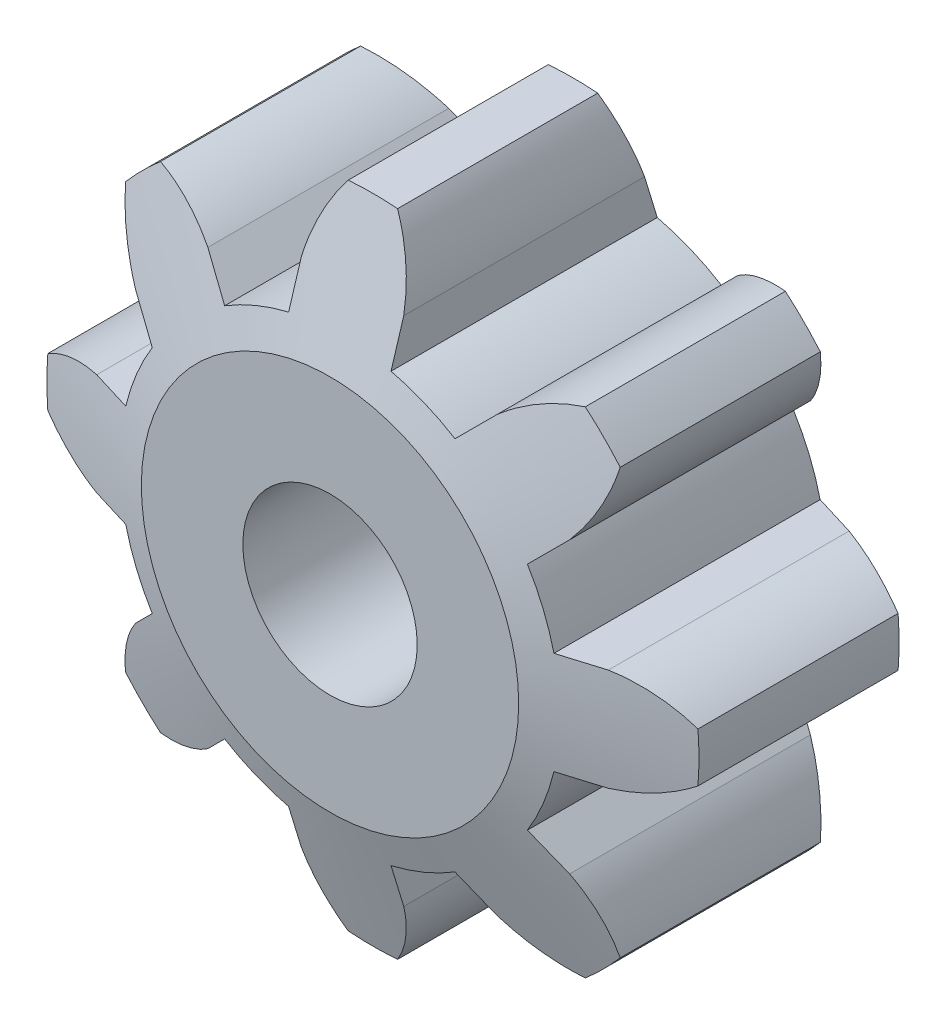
ISO-10303-21;
HEADER;
FILE_DESCRIPTION(('STEP AP214'),'2;1');
FILE_NAME('part.step','',(''),(''),'','','');
FILE_SCHEMA(('AUTOMOTIVE_DESIGN { 1 0 10303 214 1 1 1 1 }'));
ENDSEC;
DATA;
#1=APPLICATION_CONTEXT('core data for automotive mechanical design processes');
#2=APPLICATION_PROTOCOL_DEFINITION('international standard','automotive_design',2000,#1);
#3=PRODUCT_CONTEXT('',#1,'mechanical');
#4=PRODUCT('Part','Part','',(#3));
#5=PRODUCT_RELATED_PRODUCT_CATEGORY('part','',(#4));
#6=PRODUCT_DEFINITION_FORMATION('','',#4);
#7=PRODUCT_DEFINITION_CONTEXT('part definition',#1,'design');
#8=PRODUCT_DEFINITION('design','',#6,#7);
#9=PRODUCT_DEFINITION_SHAPE('','',#8);
#10=(LENGTH_UNIT() NAMED_UNIT(*) SI_UNIT(.MILLI.,.METRE.));
#11=(NAMED_UNIT(*) PLANE_ANGLE_UNIT() SI_UNIT($,.RADIAN.));
#12=(NAMED_UNIT(*) SI_UNIT($,.STERADIAN.) SOLID_ANGLE_UNIT());
#13=UNCERTAINTY_MEASURE_WITH_UNIT(LENGTH_MEASURE(1.E-05),#10,'distance_accuracy_value','');
#14=(GEOMETRIC_REPRESENTATION_CONTEXT(3) GLOBAL_UNCERTAINTY_ASSIGNED_CONTEXT((#13)) GLOBAL_UNIT_ASSIGNED_CONTEXT((#10,
#11,#12)) REPRESENTATION_CONTEXT('',''));
#15=CARTESIAN_POINT('',(0.,0.,0.));
#16=DIRECTION('',(0.,0.,1.));
#17=DIRECTION('',(1.,0.,0.));
#18=AXIS2_PLACEMENT_3D('',#15,#16,#17);
#19=CARTESIAN_POINT('',(0.,0.,5.));
#20=DIRECTION('',(0.,0.,1.));
#21=DIRECTION('',(1.,0.,0.));
#22=AXIS2_PLACEMENT_3D('',#19,#20,#21);
#23=CYLINDRICAL_SURFACE('',#22,11.405);
#24=CARTESIAN_POINT('',(0.,0.,3.5));
#25=DIRECTION('',(0.,0.,1.));
#26=DIRECTION('',(1.,0.,0.));
#27=AXIS2_PLACEMENT_3D('',#24,#25,#26);
#28=CIRCLE('',#27,11.405);
#29=CARTESIAN_POINT('',(-11.3722272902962,0.863985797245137,3.5));
#30=VERTEX_POINT('',#29);
#31=CARTESIAN_POINT('',(-11.3722272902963,-0.863985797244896,3.5));
#32=VERTEX_POINT('',#31);
#33=EDGE_CURVE('E1007',#30,#32,#28,.T.);
#34=ORIENTED_EDGE('',*,*,#33,.F.);
#35=DIRECTION('',(0.,0.,1.));
#36=VECTOR('',#35,1.);
#37=CARTESIAN_POINT('',(-11.3722272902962,0.863985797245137,-5.));
#38=LINE('',#37,#36);
#39=CARTESIAN_POINT('',(-11.3722272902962,0.863985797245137,-3.5));
#40=VERTEX_POINT('',#39);
#41=EDGE_CURVE('E1399',#40,#30,#38,.T.);
#42=ORIENTED_EDGE('',*,*,#41,.F.);
#43=CARTESIAN_POINT('',(0.,0.,-3.5));
#44=DIRECTION('',(0.,0.,1.));
#45=DIRECTION('',(1.,0.,0.));
#46=AXIS2_PLACEMENT_3D('',#43,#44,#45);
#47=CIRCLE('',#46,11.405);
#48=CARTESIAN_POINT('',(-11.3722272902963,-0.863985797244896,-3.5));
#49=VERTEX_POINT('',#48);
#50=EDGE_CURVE('E661',#40,#49,#47,.T.);
#51=ORIENTED_EDGE('',*,*,#50,.T.);
#52=DIRECTION('',(0.,0.,1.));
#53=VECTOR('',#52,1.);
#54=CARTESIAN_POINT('',(-11.3722272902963,-0.863985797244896,-5.));
#55=LINE('',#54,#53);
#56=EDGE_CURVE('E1407',#49,#32,#55,.T.);
#57=ORIENTED_EDGE('',*,*,#56,.T.);
#58=EDGE_LOOP('',(#34,#42,#51,#57));
#59=FACE_BOUND('',#58,.T.);
#60=ADVANCED_FACE('F321',(#59),#23,.T.);
#61=CARTESIAN_POINT('',(-8.65230925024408,-7.43044881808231,-3.5));
#62=VERTEX_POINT('',#61);
#63=CARTESIAN_POINT('',(-7.43044881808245,-8.65230925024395,-3.5));
#64=VERTEX_POINT('',#63);
#65=EDGE_CURVE('E666',#62,#64,#47,.T.);
#66=ORIENTED_EDGE('',*,*,#65,.T.);
#67=DIRECTION('',(0.,0.,1.));
#68=VECTOR('',#67,1.);
#69=CARTESIAN_POINT('',(-7.43044881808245,-8.65230925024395,-5.));
#70=LINE('',#69,#68);
#71=CARTESIAN_POINT('',(-7.43044881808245,-8.65230925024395,3.5));
#72=VERTEX_POINT('',#71);
#73=EDGE_CURVE('E1441',#64,#72,#70,.T.);
#74=ORIENTED_EDGE('',*,*,#73,.T.);
#75=CARTESIAN_POINT('',(-8.65230925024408,-7.43044881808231,3.5));
#76=VERTEX_POINT('',#75);
#77=EDGE_CURVE('E1010',#76,#72,#28,.T.);
#78=ORIENTED_EDGE('',*,*,#77,.F.);
#79=DIRECTION('',(0.,0.,1.));
#80=VECTOR('',#79,1.);
#81=CARTESIAN_POINT('',(-8.65230925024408,-7.43044881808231,-5.));
#82=LINE('',#81,#80);
#83=EDGE_CURVE('E1454',#62,#76,#82,.T.);
#84=ORIENTED_EDGE('',*,*,#83,.F.);
#85=EDGE_LOOP('',(#66,#74,#78,#84));
#86=FACE_BOUND('',#85,.T.);
#87=ADVANCED_FACE('F1506',(#86),#23,.T.);
#88=CARTESIAN_POINT('',(-7.43044881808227,8.65230925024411,-3.5));
#89=VERTEX_POINT('',#88);
#90=CARTESIAN_POINT('',(-8.65230925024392,7.43044881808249,-3.5));
#91=VERTEX_POINT('',#90);
#92=EDGE_CURVE('E649',#89,#91,#47,.T.);
#93=ORIENTED_EDGE('',*,*,#92,.T.);
#94=DIRECTION('',(0.,0.,1.));
#95=VECTOR('',#94,1.);
#96=CARTESIAN_POINT('',(-8.65230925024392,7.43044881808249,-5.));
#97=LINE('',#96,#95);
#98=CARTESIAN_POINT('',(-8.65230925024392,7.43044881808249,3.5));
#99=VERTEX_POINT('',#98);
#100=EDGE_CURVE('E1402',#91,#99,#97,.T.);
#101=ORIENTED_EDGE('',*,*,#100,.T.);
#102=CARTESIAN_POINT('',(-7.43044881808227,8.65230925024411,3.5));
#103=VERTEX_POINT('',#102);
#104=EDGE_CURVE('E651',#103,#99,#28,.T.);
#105=ORIENTED_EDGE('',*,*,#104,.F.);
#106=DIRECTION('',(0.,0.,1.));
#107=VECTOR('',#106,1.);
#108=CARTESIAN_POINT('',(-7.43044881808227,8.65230925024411,-5.));
#109=LINE('',#108,#107);
#110=EDGE_CURVE('E634',#89,#103,#109,.T.);
#111=ORIENTED_EDGE('',*,*,#110,.F.);
#112=EDGE_LOOP('',(#93,#101,#105,#111));
#113=FACE_BOUND('',#112,.T.);
#114=ADVANCED_FACE('F647',(#113),#23,.T.);
#115=CARTESIAN_POINT('',(7.43044881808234,-8.652309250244,-3.5));
#116=VERTEX_POINT('',#115);
#117=CARTESIAN_POINT('',(8.65230925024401,-7.43044881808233,-3.5));
#118=VERTEX_POINT('',#117);
#119=EDGE_CURVE('E671',#116,#118,#47,.T.);
#120=ORIENTED_EDGE('',*,*,#119,.T.);
#121=DIRECTION('',(0.,0.,1.));
#122=VECTOR('',#121,1.);
#123=CARTESIAN_POINT('',(8.65230925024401,-7.43044881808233,-5.));
#124=LINE('',#123,#122);
#125=CARTESIAN_POINT('',(8.65230925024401,-7.43044881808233,3.50000000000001));
#126=VERTEX_POINT('',#125);
#127=EDGE_CURVE('E1054',#118,#126,#124,.T.);
#128=ORIENTED_EDGE('',*,*,#127,.T.);
#129=CARTESIAN_POINT('',(7.43044881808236,-8.65230925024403,3.5));
#130=VERTEX_POINT('',#129);
#131=EDGE_CURVE('E992',#130,#126,#28,.T.);
#132=ORIENTED_EDGE('',*,*,#131,.F.);
#133=DIRECTION('',(0.,0.,1.));
#134=VECTOR('',#133,1.);
#135=CARTESIAN_POINT('',(7.43044881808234,-8.652309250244,-5.));
#136=LINE('',#135,#134);
#137=EDGE_CURVE('E1036',#116,#130,#136,.T.);
#138=ORIENTED_EDGE('',*,*,#137,.F.);
#139=EDGE_LOOP('',(#120,#128,#132,#138));
#140=FACE_BOUND('',#139,.T.);
#141=ADVANCED_FACE('F1581',(#140),#23,.T.);
#142=CARTESIAN_POINT('',(-0.863985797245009,-11.3722272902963,3.5));
#143=VERTEX_POINT('',#142);
#144=CARTESIAN_POINT('',(0.863985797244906,-11.3722272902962,3.50000000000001));
#145=VERTEX_POINT('',#144);
#146=EDGE_CURVE('E997',#143,#145,#28,.T.);
#147=ORIENTED_EDGE('',*,*,#146,.F.);
#148=DIRECTION('',(0.,0.,1.));
#149=VECTOR('',#148,1.);
#150=CARTESIAN_POINT('',(-0.863985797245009,-11.3722272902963,-5.));
#151=LINE('',#150,#149);
#152=CARTESIAN_POINT('',(-0.863985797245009,-11.3722272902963,-3.5));
#153=VERTEX_POINT('',#152);
#154=EDGE_CURVE('E1030',#153,#143,#151,.T.);
#155=ORIENTED_EDGE('',*,*,#154,.F.);
#156=CARTESIAN_POINT('',(0.863985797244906,-11.3722272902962,-3.5));
#157=VERTEX_POINT('',#156);
#158=EDGE_CURVE('E1033',#153,#157,#47,.T.);
#159=ORIENTED_EDGE('',*,*,#158,.T.);
#160=DIRECTION('',(0.,0.,1.));
#161=VECTOR('',#160,1.);
#162=CARTESIAN_POINT('',(0.863985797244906,-11.3722272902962,-5.));
#163=LINE('',#162,#161);
#164=EDGE_CURVE('E1032',#157,#145,#163,.T.);
#165=ORIENTED_EDGE('',*,*,#164,.T.);
#166=EDGE_LOOP('',(#147,#155,#159,#165));
#167=FACE_BOUND('',#166,.T.);
#168=ADVANCED_FACE('F1028',(#167),#23,.T.);
#169=CARTESIAN_POINT('',(8.65230925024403,7.43044881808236,-3.5));
#170=VERTEX_POINT('',#169);
#171=CARTESIAN_POINT('',(7.43044881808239,8.652309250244,-3.5));
#172=VERTEX_POINT('',#171);
#173=EDGE_CURVE('E664',#170,#172,#47,.T.);
#174=ORIENTED_EDGE('',*,*,#173,.T.);
#175=DIRECTION('',(0.,0.,1.));
#176=VECTOR('',#175,1.);
#177=CARTESIAN_POINT('',(7.43044881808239,8.652309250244,-5.));
#178=LINE('',#177,#176);
#179=CARTESIAN_POINT('',(7.43044881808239,8.652309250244,3.5));
#180=VERTEX_POINT('',#179);
#181=EDGE_CURVE('E1092',#172,#180,#178,.T.);
#182=ORIENTED_EDGE('',*,*,#181,.T.);
#183=CARTESIAN_POINT('',(8.65230925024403,7.43044881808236,3.5));
#184=VERTEX_POINT('',#183);
#185=EDGE_CURVE('E672',#184,#180,#28,.T.);
#186=ORIENTED_EDGE('',*,*,#185,.F.);
#187=DIRECTION('',(0.,0.,1.));
#188=VECTOR('',#187,1.);
#189=CARTESIAN_POINT('',(8.65230925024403,7.43044881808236,-5.));
#190=LINE('',#189,#188);
#191=EDGE_CURVE('E1105',#170,#184,#190,.T.);
#192=ORIENTED_EDGE('',*,*,#191,.F.);
#193=EDGE_LOOP('',(#174,#182,#186,#192));
#194=FACE_BOUND('',#193,.T.);
#195=ADVANCED_FACE('F1520',(#194),#23,.T.);
#196=CARTESIAN_POINT('',(11.3722272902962,-0.863985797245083,3.5));
#197=VERTEX_POINT('',#196);
#198=CARTESIAN_POINT('',(11.3722272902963,0.863985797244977,3.5));
#199=VERTEX_POINT('',#198);
#200=EDGE_CURVE('E673',#197,#199,#28,.T.);
#201=ORIENTED_EDGE('',*,*,#200,.F.);
#202=DIRECTION('',(0.,0.,1.));
#203=VECTOR('',#202,1.);
#204=CARTESIAN_POINT('',(11.3722272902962,-0.86398579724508,-5.));
#205=LINE('',#204,#203);
#206=CARTESIAN_POINT('',(11.3722272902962,-0.86398579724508,-3.5));
#207=VERTEX_POINT('',#206);
#208=EDGE_CURVE('E349',#207,#197,#205,.T.);
#209=ORIENTED_EDGE('',*,*,#208,.F.);
#210=CARTESIAN_POINT('',(11.3722272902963,0.863985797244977,-3.5));
#211=VERTEX_POINT('',#210);
#212=EDGE_CURVE('E667',#207,#211,#47,.T.);
#213=ORIENTED_EDGE('',*,*,#212,.T.);
#214=DIRECTION('',(0.,0.,1.));
#215=VECTOR('',#214,1.);
#216=CARTESIAN_POINT('',(11.3722272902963,0.863985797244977,-5.));
#217=LINE('',#216,#215);
#218=EDGE_CURVE('E1111',#211,#199,#217,.T.);
#219=ORIENTED_EDGE('',*,*,#218,.T.);
#220=EDGE_LOOP('',(#201,#209,#213,#219));
#221=FACE_BOUND('',#220,.T.);
#222=ADVANCED_FACE('F1514',(#221),#23,.T.);
#223=CARTESIAN_POINT('',(0.,0.,5.));
#224=DIRECTION('',(0.,0.,-1.));
#225=DIRECTION('',(-1.,0.,0.));
#226=AXIS2_PLACEMENT_3D('',#223,#224,#225);
#227=PLANE('',#226);
#228=CARTESIAN_POINT('',(0.,0.,5.));
#229=DIRECTION('',(0.,0.,-1.));
#230=DIRECTION('',(-1.,0.,0.));
#231=AXIS2_PLACEMENT_3D('',#228,#229,#230);
#232=CIRCLE('',#231,3.05);
#233=CARTESIAN_POINT('',(-3.05,0.,5.));
#234=VERTEX_POINT('',#233);
#235=EDGE_CURVE('E1119',#234,#234,#232,.T.);
#236=ORIENTED_EDGE('',*,*,#235,.T.);
#237=EDGE_LOOP('',(#236));
#238=FACE_BOUND('',#237,.T.);
#239=CARTESIAN_POINT('',(0.,0.,5.));
#240=DIRECTION('',(0.,0.,1.));
#241=DIRECTION('',(1.,0.,0.));
#242=AXIS2_PLACEMENT_3D('',#239,#240,#241);
#243=CIRCLE('',#242,6.6);
#244=CARTESIAN_POINT('',(6.6,0.,5.));
#245=VERTEX_POINT('',#244);
#246=EDGE_CURVE('E987',#245,#245,#243,.T.);
#247=ORIENTED_EDGE('',*,*,#246,.T.);
#248=EDGE_LOOP('',(#247));
#249=FACE_BOUND('',#248,.T.);
#250=ADVANCED_FACE('F323',(#238,#249),#227,.F.);
#251=CARTESIAN_POINT('',(0.,6.6,-5.));
#252=DIRECTION('',(0.,0.,1.));
#253=DIRECTION('',(1.,0.,0.));
#254=AXIS2_PLACEMENT_3D('',#251,#252,#253);
#255=PLANE('',#254);
#256=CARTESIAN_POINT('',(0.,0.,-5.));
#257=DIRECTION('',(0.,0.,1.));
#258=DIRECTION('',(1.,0.,0.));
#259=AXIS2_PLACEMENT_3D('',#256,#257,#258);
#260=CIRCLE('',#259,3.05);
#261=CARTESIAN_POINT('',(3.05,0.,-5.));
#262=VERTEX_POINT('',#261);
#263=EDGE_CURVE('E1855',#262,#262,#260,.T.);
#264=ORIENTED_EDGE('',*,*,#263,.T.);
#265=EDGE_LOOP('',(#264));
#266=FACE_BOUND('',#265,.T.);
#267=CARTESIAN_POINT('',(0.,0.,-5.));
#268=DIRECTION('',(0.,0.,1.));
#269=DIRECTION('',(1.,0.,0.));
#270=AXIS2_PLACEMENT_3D('',#267,#268,#269);
#271=CIRCLE('',#270,6.6);
#272=CARTESIAN_POINT('',(6.6,0.,-5.));
#273=VERTEX_POINT('',#272);
#274=EDGE_CURVE('E675',#273,#273,#271,.T.);
#275=ORIENTED_EDGE('',*,*,#274,.F.);
#276=EDGE_LOOP('',(#275));
#277=FACE_BOUND('',#276,.T.);
#278=ADVANCED_FACE('F717',(#266,#277),#255,.F.);
#279=CARTESIAN_POINT('',(0.,0.,-5.));
#280=DIRECTION('',(0.,0.,1.));
#281=DIRECTION('',(1.,0.,0.));
#282=AXIS2_PLACEMENT_3D('',#279,#280,#281);
#283=CONICAL_SURFACE('',#282,6.6,1.26820773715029);
#284=ORIENTED_EDGE('',*,*,#50,.F.);
#285=CARTESIAN_POINT('',(-11.3724522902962,0.86382251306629,-3.49993382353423));
#286=CARTESIAN_POINT('',(-11.2531120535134,0.950454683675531,-3.53503418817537));
#287=CARTESIAN_POINT('',(-11.1301010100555,1.03164882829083,-3.57103062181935));
#288=CARTESIAN_POINT('',(-10.8777522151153,1.18271407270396,-3.64469032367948));
#289=CARTESIAN_POINT('',(-10.7484133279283,1.25258313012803,-3.68235389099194));
#290=CARTESIAN_POINT('',(-10.4872209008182,1.37918506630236,-3.7584080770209));
#291=CARTESIAN_POINT('',(-10.3554761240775,1.43616159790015,-3.79676713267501));
#292=CARTESIAN_POINT('',(-10.0879825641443,1.53846408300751,-3.87480310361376));
#293=CARTESIAN_POINT('',(-9.95223538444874,1.58379463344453,-3.91447949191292));
#294=CARTESIAN_POINT('',(-9.6736206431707,1.66375600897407,-3.99621796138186));
#295=CARTESIAN_POINT('',(-9.53066126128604,1.69803030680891,-4.0383158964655));
#296=CARTESIAN_POINT('',(-9.2410178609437,1.75415371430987,-4.12407497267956));
#297=CARTESIAN_POINT('',(-9.09431018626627,1.77586237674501,-4.16774819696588));
#298=CARTESIAN_POINT('',(-8.94707250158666,1.79098629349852,-4.21189349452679));
#299=B_SPLINE_CURVE_WITH_KNOTS('',3,(#285,#286,#287,#288,#289,#290,#291,#292,#293,#294,#295,
#296,#297,#298),.UNSPECIFIED.,.F.,.F.,(4,2,2,2,2,2,4),(0.,0.454610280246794,0.909302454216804,
1.35450819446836,1.79953793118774,2.25774382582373,2.72097687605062),.UNSPECIFIED.);
#300=CARTESIAN_POINT('',(-8.94752250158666,1.79094000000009,-4.21175858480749));
#301=VERTEX_POINT('',#300);
#302=EDGE_CURVE('E932',#40,#301,#299,.T.);
#303=ORIENTED_EDGE('',*,*,#302,.T.);
#304=CARTESIAN_POINT('',(-8.94797250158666,1.79094000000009,-4.21162083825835));
#305=CARTESIAN_POINT('',(-8.70482805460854,1.79094000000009,-4.28607187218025));
#306=CARTESIAN_POINT('',(-8.46164164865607,1.79094000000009,-4.36038531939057));
#307=CARTESIAN_POINT('',(-7.97518490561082,1.79094000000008,-4.508737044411));
#308=CARTESIAN_POINT('',(-7.73191456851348,1.79094000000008,-4.58277532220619));
#309=CARTESIAN_POINT('',(-7.48860227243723,1.79094000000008,-4.65667601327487));
#310=B_SPLINE_CURVE_WITH_KNOTS('',3,(#304,#305,#306,#307,#308,#309),.UNSPECIFIED.,.F.,.F.,(4,2,
4),(0.,0.762862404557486,1.52572485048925),.UNSPECIFIED.);
#311=CARTESIAN_POINT('',(-7.48882727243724,1.79094000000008,-4.65660770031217));
#312=VERTEX_POINT('',#311);
#313=EDGE_CURVE('E937',#301,#312,#310,.T.);
#314=ORIENTED_EDGE('',*,*,#313,.T.);
#315=CARTESIAN_POINT('',(0.,0.,-4.65660770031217));
#316=DIRECTION('',(0.,0.,1.));
#317=DIRECTION('',(1.,0.,0.));
#318=AXIS2_PLACEMENT_3D('',#315,#316,#317);
#319=CIRCLE('',#318,7.7);
#320=CARTESIAN_POINT('',(-6.56178636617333,4.02901472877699,-4.65660770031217));
#321=VERTEX_POINT('',#320);
#322=EDGE_CURVE('E944',#321,#312,#319,.T.);
#323=ORIENTED_EDGE('',*,*,#322,.F.);
#324=CARTESIAN_POINT('',(-6.56156136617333,4.02878972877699,-4.65670430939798));
#325=CARTESIAN_POINT('',(-6.73364211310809,4.20087047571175,-4.58278949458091));
#326=CARTESIAN_POINT('',(-6.90569317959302,4.37292154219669,-4.5087370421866));
#327=CARTESIAN_POINT('',(-7.24973594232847,4.71696430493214,-4.36035686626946));
#328=CARTESIAN_POINT('',(-7.42172763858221,4.88895600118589,-4.28602914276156));
#329=CARTESIAN_POINT('',(-7.59368965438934,5.06091801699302,-4.21156378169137));
#330=B_SPLINE_CURVE_WITH_KNOTS('',3,(#324,#325,#326,#327,#328,#329),.UNSPECIFIED.,.F.,.F.,(4,2,
4),(0.,0.763008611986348,1.52601718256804),.UNSPECIFIED.);
#331=CARTESIAN_POINT('',(-7.59323965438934,5.06046801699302,-4.21175858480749));
#332=VERTEX_POINT('',#331);
#333=EDGE_CURVE('E983',#321,#332,#330,.T.);
#334=ORIENTED_EDGE('',*,*,#333,.T.);
#335=CARTESIAN_POINT('',(-7.59287359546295,5.06001801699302,-4.21193158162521));
#336=CARTESIAN_POINT('',(-7.68475635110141,5.17293270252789,-4.16851299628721));
#337=CARTESIAN_POINT('',(-7.77177352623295,5.28998887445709,-4.12555074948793));
#338=CARTESIAN_POINT('',(-7.9354564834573,5.53157224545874,-4.04068704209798));
#339=CARTESIAN_POINT('',(-8.01211760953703,5.65610276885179,-3.99878606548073));
#340=CARTESIAN_POINT('',(-8.15288215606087,5.90902044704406,-3.91710411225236));
#341=CARTESIAN_POINT('',(-8.21721662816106,6.0372705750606,-3.87729705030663));
#342=CARTESIAN_POINT('',(-8.33472588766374,6.29910495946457,-3.79903823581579));
#343=CARTESIAN_POINT('',(-8.3879060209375,6.43268662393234,-3.76058584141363));
#344=CARTESIAN_POINT('',(-8.48375154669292,6.70743330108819,-3.68428259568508));
#345=CARTESIAN_POINT('',(-8.52614721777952,6.84870203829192,-3.64646587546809));
#346=CARTESIAN_POINT('',(-8.59877992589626,7.13641591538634,-3.57209495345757));
#347=CARTESIAN_POINT('',(-8.62887791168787,7.28290093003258,-3.53555924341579));
#348=CARTESIAN_POINT('',(-8.65234501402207,7.43067381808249,-3.49994576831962));
#349=B_SPLINE_CURVE_WITH_KNOTS('',3,(#335,#336,#337,#338,#339,#340,#341,#342,#343,#344,#345,
#346,#347,#348),.UNSPECIFIED.,.F.,.F.,(4,2,2,2,2,2,4),(0.,0.455611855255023,0.9114278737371,
1.35761569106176,1.80358917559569,2.25981144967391,2.72105831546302),.UNSPECIFIED.);
#350=EDGE_CURVE('E659',#332,#91,#349,.T.);
#351=ORIENTED_EDGE('',*,*,#350,.T.);
#352=ORIENTED_EDGE('',*,*,#92,.F.);
#353=CARTESIAN_POINT('',(-7.43067381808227,8.65234501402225,-3.49994576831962));
#354=CARTESIAN_POINT('',(-7.28502938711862,8.62921542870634,-3.53504638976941));
#355=CARTESIAN_POINT('',(-7.14063463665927,8.59964492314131,-3.57104307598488));
#356=CARTESIAN_POINT('',(-6.85537821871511,8.52802365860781,-3.64470327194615));
#357=CARTESIAN_POINT('',(-6.71451719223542,8.48597065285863,-3.68236708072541));
#358=CARTESIAN_POINT('',(-6.44030590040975,8.39079790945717,-3.75842171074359));
#359=CARTESIAN_POINT('',(-6.30686024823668,8.3379273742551,-3.79678096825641));
#360=CARTESIAN_POINT('',(-6.045376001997,8.2211168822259,-3.8748173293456));
#361=CARTESIAN_POINT('',(-5.91733529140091,8.15718130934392,-3.91449390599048));
#362=CARTESIAN_POINT('',(-5.6637740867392,8.01670341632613,-3.99623625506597));
#363=CARTESIAN_POINT('',(-5.53844133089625,7.93984312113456,-4.03833798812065));
#364=CARTESIAN_POINT('',(-5.29392924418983,7.77470101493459,-4.12410490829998));
#365=CARTESIAN_POINT('',(-5.1748325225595,7.68630313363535,-4.16778218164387));
#366=CARTESIAN_POINT('',(-5.06001801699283,7.59287359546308,-4.21193158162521));
#367=B_SPLINE_CURVE_WITH_KNOTS('',3,(#353,#354,#355,#356,#357,#358,#359,#360,#361,#362,#363,
#364,#365,#366),.UNSPECIFIED.,.F.,.F.,(4,2,2,2,2,2,4),(0.,0.454610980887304,0.909303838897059,
1.35450997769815,1.79954012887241,2.25778523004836,2.72105848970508),.UNSPECIFIED.);
#368=CARTESIAN_POINT('',(-5.06046801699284,7.59323965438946,-4.21175858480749));
#369=VERTEX_POINT('',#368);
#370=EDGE_CURVE('E631',#89,#369,#367,.T.);
#371=ORIENTED_EDGE('',*,*,#370,.T.);
#372=CARTESIAN_POINT('',(-5.06091801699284,7.59368965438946,-4.21156378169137));
#373=CARTESIAN_POINT('',(-4.88895600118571,7.42172763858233,-4.28602914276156));
#374=CARTESIAN_POINT('',(-4.71696430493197,7.24973594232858,-4.36035686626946));
#375=CARTESIAN_POINT('',(-4.37292154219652,6.90569317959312,-4.5087370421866));
#376=CARTESIAN_POINT('',(-4.20087047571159,6.73364211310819,-4.58278949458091));
#377=CARTESIAN_POINT('',(-4.02878972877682,6.56156136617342,-4.65670430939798));
#378=B_SPLINE_CURVE_WITH_KNOTS('',3,(#372,#373,#374,#375,#376,#377),.UNSPECIFIED.,.F.,.F.,(4,2,
4),(0.,0.763008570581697,1.52601718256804),.UNSPECIFIED.);
#379=CARTESIAN_POINT('',(-4.02901472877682,6.56178636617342,-4.65660770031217));
#380=VERTEX_POINT('',#379);
#381=EDGE_CURVE('E641',#369,#380,#378,.T.);
#382=ORIENTED_EDGE('',*,*,#381,.T.);
#383=CARTESIAN_POINT('',(0.,0.,-4.65660770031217));
#384=DIRECTION('',(0.,0.,1.));
#385=DIRECTION('',(1.,0.,0.));
#386=AXIS2_PLACEMENT_3D('',#383,#384,#385);
#387=CIRCLE('',#386,7.7);
#388=CARTESIAN_POINT('',(-1.79094,7.48882727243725,-4.65660770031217));
#389=VERTEX_POINT('',#388);
#390=EDGE_CURVE('E1136',#389,#380,#387,.T.);
#391=ORIENTED_EDGE('',*,*,#390,.F.);
#392=CARTESIAN_POINT('',(-1.79094,7.48860227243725,-4.65667601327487));
#393=CARTESIAN_POINT('',(-1.79094,7.7319145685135,-4.58277532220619));
#394=CARTESIAN_POINT('',(-1.79094,7.97518490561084,-4.508737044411));
#395=CARTESIAN_POINT('',(-1.79094,8.4616416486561,-4.36038531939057));
#396=CARTESIAN_POINT('',(-1.79094,8.70482805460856,-4.28607187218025));
#397=CARTESIAN_POINT('',(-1.79094,8.94797250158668,-4.21162083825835));
#398=B_SPLINE_CURVE_WITH_KNOTS('',3,(#392,#393,#394,#395,#396,#397),.UNSPECIFIED.,.F.,.F.,(4,2,
4),(0.,0.762862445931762,1.52572485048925),.UNSPECIFIED.);
#399=CARTESIAN_POINT('',(-1.79094,8.94752250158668,-4.21175858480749));
#400=VERTEX_POINT('',#399);
#401=EDGE_CURVE('E725',#389,#400,#398,.T.);
#402=ORIENTED_EDGE('',*,*,#401,.T.);
#403=CARTESIAN_POINT('',(-1.79098629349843,8.94707250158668,-4.21189349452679));
#404=CARTESIAN_POINT('',(-1.77611080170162,9.09188551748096,-4.16847527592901));
#405=CARTESIAN_POINT('',(-1.75486638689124,9.23618636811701,-4.12551342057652));
#406=CARTESIAN_POINT('',(-1.69977529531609,9.52275104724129,-4.04065053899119));
#407=CARTESIAN_POINT('',(-1.66592297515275,9.66501393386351,-3.99874999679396));
#408=CARTESIAN_POINT('',(-1.58661181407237,9.94338693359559,-3.91706891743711));
#409=CARTESIAN_POINT('',(-1.54141323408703,10.0795635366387,-3.8772622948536));
#410=CARTESIAN_POINT('',(-1.43935331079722,10.3477971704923,-3.79900439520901));
#411=CARTESIAN_POINT('',(-1.38249758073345,10.479856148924,-3.76055247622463));
#412=CARTESIAN_POINT('',(-1.25599420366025,10.7418900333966,-3.68425341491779));
#413=CARTESIAN_POINT('',(-1.1860834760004,10.8717479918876,-3.6464402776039));
#414=CARTESIAN_POINT('',(-1.034006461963,11.1265272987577,-3.57207634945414));
#415=CARTESIAN_POINT('',(-0.951713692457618,11.251378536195,-3.53554404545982));
#416=CARTESIAN_POINT('',(-0.863822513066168,11.3724522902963,-3.49993382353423));
#417=B_SPLINE_CURVE_WITH_KNOTS('',3,(#403,#404,#405,#406,#407,#408,#409,#410,#411,#412,#413,
#414,#415,#416),.UNSPECIFIED.,.F.,.F.,(4,2,2,2,2,2,4),(0.,0.455610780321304,0.911425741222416,
1.35761279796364,1.8035855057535,2.25976930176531,2.72097670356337),.UNSPECIFIED.);
#418=CARTESIAN_POINT('',(-0.863985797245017,11.3722272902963,-3.5));
#419=VERTEX_POINT('',#418);
#420=EDGE_CURVE('E733',#400,#419,#417,.T.);
#421=ORIENTED_EDGE('',*,*,#420,.T.);
#422=CARTESIAN_POINT('',(0.863985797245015,11.3722272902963,-3.5));
#423=VERTEX_POINT('',#422);
#424=EDGE_CURVE('E660',#423,#419,#47,.T.);
#425=ORIENTED_EDGE('',*,*,#424,.F.);
#426=CARTESIAN_POINT('',(0.86382251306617,11.3724522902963,-3.49993382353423));
#427=CARTESIAN_POINT('',(0.950454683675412,11.2531120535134,-3.53503418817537));
#428=CARTESIAN_POINT('',(1.03164882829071,11.1301010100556,-3.57103062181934));
#429=CARTESIAN_POINT('',(1.18271407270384,10.8777522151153,-3.64469032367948));
#430=CARTESIAN_POINT('',(1.25258313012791,10.7484133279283,-3.68235389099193));
#431=CARTESIAN_POINT('',(1.37918506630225,10.4872209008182,-3.7584080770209));
#432=CARTESIAN_POINT('',(1.43616159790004,10.3554761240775,-3.79676713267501));
#433=CARTESIAN_POINT('',(1.5384640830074,10.0879825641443,-3.87480310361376));
#434=CARTESIAN_POINT('',(1.58379463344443,9.95223538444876,-3.91447949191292));
#435=CARTESIAN_POINT('',(1.66375600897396,9.67362064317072,-3.99621796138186));
#436=CARTESIAN_POINT('',(1.69803030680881,9.53066126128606,-4.0383158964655));
#437=CARTESIAN_POINT('',(1.75415371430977,9.24101786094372,-4.12407497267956));
#438=CARTESIAN_POINT('',(1.77586237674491,9.09431018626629,-4.16774819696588));
#439=CARTESIAN_POINT('',(1.79098629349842,8.94707250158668,-4.21189349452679));
#440=B_SPLINE_CURVE_WITH_KNOTS('',3,(#426,#427,#428,#429,#430,#431,#432,#433,#434,#435,#436,
#437,#438,#439),.UNSPECIFIED.,.F.,.F.,(4,2,2,2,2,2,4),(0.,0.454610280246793,0.909302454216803,
1.35450819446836,1.79953793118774,2.25774382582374,2.72097687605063),.UNSPECIFIED.);
#441=CARTESIAN_POINT('',(1.79094,8.94752250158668,-4.21175858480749));
#442=VERTEX_POINT('',#441);
#443=EDGE_CURVE('E771',#423,#442,#440,.T.);
#444=ORIENTED_EDGE('',*,*,#443,.T.);
#445=CARTESIAN_POINT('',(1.79094,8.94797250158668,-4.21162083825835));
#446=CARTESIAN_POINT('',(1.79094,8.70482805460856,-4.28607187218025));
#447=CARTESIAN_POINT('',(1.79094,8.4616416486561,-4.36038531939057));
#448=CARTESIAN_POINT('',(1.79094,7.97518490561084,-4.508737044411));
#449=CARTESIAN_POINT('',(1.79094,7.7319145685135,-4.58277532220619));
#450=CARTESIAN_POINT('',(1.79094,7.48860227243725,-4.65667601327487));
#451=B_SPLINE_CURVE_WITH_KNOTS('',3,(#445,#446,#447,#448,#449,#450),.UNSPECIFIED.,.F.,.F.,(4,2,
4),(0.,0.762862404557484,1.52572485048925),.UNSPECIFIED.);
#452=CARTESIAN_POINT('',(1.79094,7.48882727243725,-4.65660770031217));
#453=VERTEX_POINT('',#452);
#454=EDGE_CURVE('E778',#442,#453,#451,.T.);
#455=ORIENTED_EDGE('',*,*,#454,.T.);
#456=CARTESIAN_POINT('',(0.,0.,-4.65660770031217));
#457=DIRECTION('',(0.,0.,1.));
#458=DIRECTION('',(1.,0.,0.));
#459=AXIS2_PLACEMENT_3D('',#456,#457,#458);
#460=CIRCLE('',#459,7.7);
#461=CARTESIAN_POINT('',(4.02901472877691,6.56178636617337,-4.65660770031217));
#462=VERTEX_POINT('',#461);
#463=EDGE_CURVE('E1069',#462,#453,#460,.T.);
#464=ORIENTED_EDGE('',*,*,#463,.F.);
#465=CARTESIAN_POINT('',(4.02878972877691,6.56156136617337,-4.65670430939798));
#466=CARTESIAN_POINT('',(4.20087047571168,6.73364211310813,-4.58278949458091));
#467=CARTESIAN_POINT('',(4.37292154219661,6.90569317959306,-4.5087370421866));
#468=CARTESIAN_POINT('',(4.71696430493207,7.24973594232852,-4.36035686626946));
#469=CARTESIAN_POINT('',(4.88895600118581,7.42172763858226,-4.28602914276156));
#470=CARTESIAN_POINT('',(5.06091801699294,7.59368965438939,-4.21156378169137));
#471=B_SPLINE_CURVE_WITH_KNOTS('',3,(#465,#466,#467,#468,#469,#470),.UNSPECIFIED.,.F.,.F.,(4,2,
4),(0.,0.763008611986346,1.52601718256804),.UNSPECIFIED.);
#472=CARTESIAN_POINT('',(5.06046801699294,7.59323965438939,-4.21175858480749));
#473=VERTEX_POINT('',#472);
#474=EDGE_CURVE('E786',#462,#473,#471,.T.);
#475=ORIENTED_EDGE('',*,*,#474,.T.);
#476=CARTESIAN_POINT('',(5.06001801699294,7.59287359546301,-4.21193158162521));
#477=CARTESIAN_POINT('',(5.1729327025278,7.68475635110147,-4.16851299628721));
#478=CARTESIAN_POINT('',(5.28998887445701,7.771773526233,-4.12555074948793));
#479=CARTESIAN_POINT('',(5.53157224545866,7.93545648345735,-4.04068704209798));
#480=CARTESIAN_POINT('',(5.6561027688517,8.01211760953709,-3.99878606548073));
#481=CARTESIAN_POINT('',(5.90902044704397,8.15288215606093,-3.91710411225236));
#482=CARTESIAN_POINT('',(6.03727057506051,8.21721662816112,-3.87729705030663));
#483=CARTESIAN_POINT('',(6.29910495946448,8.33472588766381,-3.79903823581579));
#484=CARTESIAN_POINT('',(6.43268662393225,8.38790602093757,-3.76058584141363));
#485=CARTESIAN_POINT('',(6.7074333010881,8.48375154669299,-3.68428259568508));
#486=CARTESIAN_POINT('',(6.84870203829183,8.5261472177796,-3.64646587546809));
#487=CARTESIAN_POINT('',(7.13641591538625,8.59877992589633,-3.57209495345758));
#488=CARTESIAN_POINT('',(7.28290093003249,8.62887791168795,-3.53555924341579));
#489=CARTESIAN_POINT('',(7.43067381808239,8.65234501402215,-3.49994576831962));
#490=B_SPLINE_CURVE_WITH_KNOTS('',3,(#476,#477,#478,#479,#480,#481,#482,#483,#484,#485,#486,
#487,#488,#489),.UNSPECIFIED.,.F.,.F.,(4,2,2,2,2,2,4),(0.,0.455611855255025,0.911427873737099,
1.35761569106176,1.80358917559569,2.2598114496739,2.72105831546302),.UNSPECIFIED.);
#491=EDGE_CURVE('E794',#473,#172,#490,.T.);
#492=ORIENTED_EDGE('',*,*,#491,.T.);
#493=ORIENTED_EDGE('',*,*,#173,.F.);
#494=CARTESIAN_POINT('',(8.65234501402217,7.43067381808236,-3.49994576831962));
#495=CARTESIAN_POINT('',(8.62921542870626,7.28502938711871,-3.53504638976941));
#496=CARTESIAN_POINT('',(8.59964492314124,7.14063463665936,-3.57104307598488));
#497=CARTESIAN_POINT('',(8.52802365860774,6.8553782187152,-3.64470327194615));
#498=CARTESIAN_POINT('',(8.48597065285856,6.71451719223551,-3.68236708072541));
#499=CARTESIAN_POINT('',(8.3907979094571,6.44030590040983,-3.75842171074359));
#500=CARTESIAN_POINT('',(8.33792737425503,6.30686024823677,-3.79678096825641));
#501=CARTESIAN_POINT('',(8.22111688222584,6.04537600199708,-3.8748173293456));
#502=CARTESIAN_POINT('',(8.15718130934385,5.917335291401,-3.91449390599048));
#503=CARTESIAN_POINT('',(8.01670341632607,5.66377408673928,-3.99623625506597));
#504=CARTESIAN_POINT('',(7.9398431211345,5.53844133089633,-4.03833798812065));
#505=CARTESIAN_POINT('',(7.77470101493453,5.29392924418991,-4.12410490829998));
#506=CARTESIAN_POINT('',(7.68630313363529,5.17483252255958,-4.16778218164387));
#507=CARTESIAN_POINT('',(7.59287359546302,5.06001801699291,-4.21193158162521));
#508=B_SPLINE_CURVE_WITH_KNOTS('',3,(#494,#495,#496,#497,#498,#499,#500,#501,#502,#503,#504,
#505,#506,#507),.UNSPECIFIED.,.F.,.F.,(4,2,2,2,2,2,4),(0.,0.454610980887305,0.909303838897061,
1.35450997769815,1.79954012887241,2.25778523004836,2.72105848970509),.UNSPECIFIED.);
#509=CARTESIAN_POINT('',(7.59323965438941,5.06046801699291,-4.21175858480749));
#510=VERTEX_POINT('',#509);
#511=EDGE_CURVE('E740',#170,#510,#508,.T.);
#512=ORIENTED_EDGE('',*,*,#511,.T.);
#513=CARTESIAN_POINT('',(7.59368965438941,5.06091801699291,-4.21156378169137));
#514=CARTESIAN_POINT('',(7.42172763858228,4.88895600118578,-4.28602914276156));
#515=CARTESIAN_POINT('',(7.24973594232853,4.71696430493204,-4.36035686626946));
#516=CARTESIAN_POINT('',(6.90569317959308,4.37292154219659,-4.5087370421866));
#517=CARTESIAN_POINT('',(6.73364211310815,4.20087047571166,-4.58278949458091));
#518=CARTESIAN_POINT('',(6.56156136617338,4.02878972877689,-4.65670430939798));
#519=B_SPLINE_CURVE_WITH_KNOTS('',3,(#513,#514,#515,#516,#517,#518),.UNSPECIFIED.,.F.,.F.,(4,2,
4),(0.,0.763008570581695,1.52601718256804),.UNSPECIFIED.);
#520=CARTESIAN_POINT('',(6.56178636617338,4.02901472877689,-4.65660770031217));
#521=VERTEX_POINT('',#520);
#522=EDGE_CURVE('E747',#510,#521,#519,.T.);
#523=ORIENTED_EDGE('',*,*,#522,.T.);
#524=CARTESIAN_POINT('',(0.,0.,-4.65660770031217));
#525=DIRECTION('',(0.,0.,1.));
#526=DIRECTION('',(1.,0.,0.));
#527=AXIS2_PLACEMENT_3D('',#524,#525,#526);
#528=CIRCLE('',#527,7.7);
#529=CARTESIAN_POINT('',(7.48882727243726,1.79093999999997,-4.65660770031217));
#530=VERTEX_POINT('',#529);
#531=EDGE_CURVE('E1125',#530,#521,#528,.T.);
#532=ORIENTED_EDGE('',*,*,#531,.F.);
#533=CARTESIAN_POINT('',(7.48860227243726,1.79093999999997,-4.65667601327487));
#534=CARTESIAN_POINT('',(7.7319145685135,1.79093999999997,-4.58277532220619));
#535=CARTESIAN_POINT('',(7.97518490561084,1.79093999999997,-4.508737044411));
#536=CARTESIAN_POINT('',(8.4616416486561,1.79093999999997,-4.36038531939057));
#537=CARTESIAN_POINT('',(8.70482805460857,1.79093999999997,-4.28607187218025));
#538=CARTESIAN_POINT('',(8.94797250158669,1.79093999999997,-4.21162083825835));
#539=B_SPLINE_CURVE_WITH_KNOTS('',3,(#533,#534,#535,#536,#537,#538),.UNSPECIFIED.,.F.,.F.,(4,2,
4),(0.,0.762862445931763,1.52572485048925),.UNSPECIFIED.);
#540=CARTESIAN_POINT('',(8.94752250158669,1.79093999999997,-4.21175858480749));
#541=VERTEX_POINT('',#540);
#542=EDGE_CURVE('E755',#530,#541,#539,.T.);
#543=ORIENTED_EDGE('',*,*,#542,.T.);
#544=CARTESIAN_POINT('',(8.94707250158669,1.79098629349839,-4.21189349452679));
#545=CARTESIAN_POINT('',(9.09188551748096,1.77611080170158,-4.16847527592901));
#546=CARTESIAN_POINT('',(9.23618636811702,1.75486638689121,-4.12551342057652));
#547=CARTESIAN_POINT('',(9.5227510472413,1.69977529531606,-4.04065053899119));
#548=CARTESIAN_POINT('',(9.66501393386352,1.66592297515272,-3.99874999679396));
#549=CARTESIAN_POINT('',(9.9433869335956,1.58661181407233,-3.91706891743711));
#550=CARTESIAN_POINT('',(10.0795635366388,1.54141323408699,-3.8772622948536));
#551=CARTESIAN_POINT('',(10.3477971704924,1.43935331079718,-3.799004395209));
#552=CARTESIAN_POINT('',(10.479856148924,1.38249758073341,-3.76055247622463));
#553=CARTESIAN_POINT('',(10.7418900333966,1.25599420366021,-3.68425341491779));
#554=CARTESIAN_POINT('',(10.8717479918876,1.18608347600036,-3.6464402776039));
#555=CARTESIAN_POINT('',(11.1265272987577,1.03400646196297,-3.57207634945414));
#556=CARTESIAN_POINT('',(11.251378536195,0.95171369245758,-3.53554404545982));
#557=CARTESIAN_POINT('',(11.3724522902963,0.86382251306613,-3.49993382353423));
#558=B_SPLINE_CURVE_WITH_KNOTS('',3,(#544,#545,#546,#547,#548,#549,#550,#551,#552,#553,#554,
#555,#556,#557),.UNSPECIFIED.,.F.,.F.,(4,2,2,2,2,2,4),(0.,0.455610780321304,0.911425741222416,
1.35761279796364,1.80358550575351,2.25976930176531,2.72097670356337),.UNSPECIFIED.);
#559=EDGE_CURVE('E763',#541,#211,#558,.T.);
#560=ORIENTED_EDGE('',*,*,#559,.T.);
#561=ORIENTED_EDGE('',*,*,#212,.F.);
#562=CARTESIAN_POINT('',(11.3724522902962,-0.863822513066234,-3.49993382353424));
#563=CARTESIAN_POINT('',(11.2531120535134,-0.950454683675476,-3.53503418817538));
#564=CARTESIAN_POINT('',(11.1301010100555,-1.03164882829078,-3.57103062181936));
#565=CARTESIAN_POINT('',(10.8777522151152,-1.1827140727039,-3.64469032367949));
#566=CARTESIAN_POINT('',(10.7484133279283,-1.25258313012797,-3.68235389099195));
#567=CARTESIAN_POINT('',(10.4872209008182,-1.37918506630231,-3.75840807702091));
#568=CARTESIAN_POINT('',(10.3554761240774,-1.43616159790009,-3.79676713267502));
#569=CARTESIAN_POINT('',(10.0879825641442,-1.53846408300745,-3.87480310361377));
#570=CARTESIAN_POINT('',(9.95223538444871,-1.58379463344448,-3.91447949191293));
#571=CARTESIAN_POINT('',(9.67362064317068,-1.66375600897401,-3.99621796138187));
#572=CARTESIAN_POINT('',(9.53066126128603,-1.69803030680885,-4.03831589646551));
#573=CARTESIAN_POINT('',(9.2410178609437,-1.75415371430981,-4.12407497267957));
#574=CARTESIAN_POINT('',(9.09431018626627,-1.77586237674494,-4.16774819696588));
#575=CARTESIAN_POINT('',(8.94707250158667,-1.79098629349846,-4.21189349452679));
#576=B_SPLINE_CURVE_WITH_KNOTS('',3,(#562,#563,#564,#565,#566,#567,#568,#569,#570,#571,#572,
#573,#574,#575),.UNSPECIFIED.,.F.,.F.,(4,2,2,2,2,2,4),(0.,0.454610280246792,0.909302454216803,
1.35450819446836,1.79953793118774,2.25774382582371,2.72097687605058),.UNSPECIFIED.);
#577=CARTESIAN_POINT('',(8.94752250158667,-1.79094000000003,-4.21175858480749));
#578=VERTEX_POINT('',#577);
#579=EDGE_CURVE('E833',#207,#578,#576,.T.);
#580=ORIENTED_EDGE('',*,*,#579,.T.);
#581=CARTESIAN_POINT('',(8.94797250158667,-1.79094000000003,-4.21162083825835));
#582=CARTESIAN_POINT('',(8.70482805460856,-1.79094000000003,-4.28607187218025));
#583=CARTESIAN_POINT('',(8.46164164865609,-1.79094000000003,-4.36038531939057));
#584=CARTESIAN_POINT('',(7.97518490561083,-1.79094000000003,-4.508737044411));
#585=CARTESIAN_POINT('',(7.73191456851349,-1.79094000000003,-4.58277532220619));
#586=CARTESIAN_POINT('',(7.48860227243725,-1.79094000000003,-4.65667601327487));
#587=B_SPLINE_CURVE_WITH_KNOTS('',3,(#581,#582,#583,#584,#585,#586),.UNSPECIFIED.,.F.,.F.,(4,2,
4),(0.,0.762862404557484,1.52572485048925),.UNSPECIFIED.);
#588=CARTESIAN_POINT('',(7.48882727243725,-1.79094000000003,-4.65660770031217));
#589=VERTEX_POINT('',#588);
#590=EDGE_CURVE('E840',#578,#589,#587,.T.);
#591=ORIENTED_EDGE('',*,*,#590,.T.);
#592=CARTESIAN_POINT('',(0.,0.,-4.65660770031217));
#593=DIRECTION('',(0.,0.,1.));
#594=DIRECTION('',(1.,0.,0.));
#595=AXIS2_PLACEMENT_3D('',#592,#593,#594);
#596=CIRCLE('',#595,7.7);
#597=CARTESIAN_POINT('',(6.56178636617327,-4.02901472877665,-4.65660770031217));
#598=VERTEX_POINT('',#597);
#599=EDGE_CURVE('E1481',#598,#589,#596,.T.);
#600=ORIENTED_EDGE('',*,*,#599,.F.);
#601=CARTESIAN_POINT('',(6.56156136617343,-4.02878972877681,-4.65670430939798));
#602=CARTESIAN_POINT('',(6.73364211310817,-4.20087047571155,-4.58278949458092));
#603=CARTESIAN_POINT('',(6.90569317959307,-4.37292154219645,-4.50873704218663));
#604=CARTESIAN_POINT('',(7.24973594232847,-4.71696430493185,-4.36035686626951));
#605=CARTESIAN_POINT('',(7.42172763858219,-4.88895600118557,-4.28602914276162));
#606=CARTESIAN_POINT('',(7.59368965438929,-5.06091801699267,-4.21156378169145));
#607=B_SPLINE_CURVE_WITH_KNOTS('',3,(#601,#602,#603,#604,#605,#606),.UNSPECIFIED.,.F.,.F.,(4,2,
4),(0.,0.763008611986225,1.5260171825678),.UNSPECIFIED.);
#608=CARTESIAN_POINT('',(7.59323965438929,-5.06046801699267,-4.21175858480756));
#609=VERTEX_POINT('',#608);
#610=EDGE_CURVE('E848',#598,#609,#607,.T.);
#611=ORIENTED_EDGE('',*,*,#610,.T.);
#612=CARTESIAN_POINT('',(7.59287359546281,-5.06001801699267,-4.21193158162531));
#613=CARTESIAN_POINT('',(7.68475635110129,-5.17293270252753,-4.1685129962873));
#614=CARTESIAN_POINT('',(7.77177352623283,-5.28998887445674,-4.12555074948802));
#615=CARTESIAN_POINT('',(7.9354564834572,-5.53157224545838,-4.04068704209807));
#616=CARTESIAN_POINT('',(8.01211760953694,-5.65610276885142,-3.99878606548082));
#617=CARTESIAN_POINT('',(8.15288215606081,-5.90902044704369,-3.91710411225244));
#618=CARTESIAN_POINT('',(8.217216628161,-6.03727057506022,-3.87729705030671));
#619=CARTESIAN_POINT('',(8.33472588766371,-6.29910495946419,-3.79903823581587));
#620=CARTESIAN_POINT('',(8.38790602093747,-6.43268662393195,-3.76058584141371));
#621=CARTESIAN_POINT('',(8.48375154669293,-6.70743330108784,-3.68428259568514));
#622=CARTESIAN_POINT('',(8.52614721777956,-6.8487020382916,-3.64646587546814));
#623=CARTESIAN_POINT('',(8.59877992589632,-7.13641591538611,-3.57209495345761));
#624=CARTESIAN_POINT('',(8.62887791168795,-7.28290093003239,-3.53555924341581));
#625=CARTESIAN_POINT('',(8.65234501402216,-7.43067381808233,-3.49994576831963));
#626=B_SPLINE_CURVE_WITH_KNOTS('',3,(#612,#613,#614,#615,#616,#617,#618,#619,#620,#621,#622,
#623,#624,#625),.UNSPECIFIED.,.F.,.F.,(4,2,2,2,2,2,4),(0.,0.45561185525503,0.911427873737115,
1.35761569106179,1.80358917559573,2.25981144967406,2.72105831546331),.UNSPECIFIED.);
#627=EDGE_CURVE('E856',#609,#118,#626,.T.);
#628=ORIENTED_EDGE('',*,*,#627,.T.);
#629=ORIENTED_EDGE('',*,*,#119,.F.);
#630=CARTESIAN_POINT('',(7.43067381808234,-8.65234501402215,-3.49994576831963));
#631=CARTESIAN_POINT('',(7.28502938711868,-8.62921542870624,-3.53504638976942));
#632=CARTESIAN_POINT('',(7.14063463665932,-8.59964492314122,-3.57104307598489));
#633=CARTESIAN_POINT('',(6.85537821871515,-8.52802365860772,-3.64470327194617));
#634=CARTESIAN_POINT('',(6.71451719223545,-8.48597065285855,-3.68236708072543));
#635=CARTESIAN_POINT('',(6.44030590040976,-8.39079790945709,-3.7584217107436));
#636=CARTESIAN_POINT('',(6.30686024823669,-8.33792737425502,-3.79678096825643));
#637=CARTESIAN_POINT('',(6.04537600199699,-8.22111688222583,-3.87481732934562));
#638=CARTESIAN_POINT('',(5.9173352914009,-8.15718130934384,-3.9144939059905));
#639=CARTESIAN_POINT('',(5.66377408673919,-8.01670341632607,-3.99623625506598));
#640=CARTESIAN_POINT('',(5.53844133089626,-7.93984312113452,-4.03833798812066));
#641=CARTESIAN_POINT('',(5.29392924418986,-7.77470101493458,-4.12410490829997));
#642=CARTESIAN_POINT('',(5.17483252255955,-7.68630313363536,-4.16778218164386));
#643=CARTESIAN_POINT('',(5.06001801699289,-7.59287359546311,-4.21193158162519));
#644=B_SPLINE_CURVE_WITH_KNOTS('',3,(#630,#631,#632,#633,#634,#635,#636,#637,#638,#639,#640,
#641,#642,#643),.UNSPECIFIED.,.F.,.F.,(4,2,2,2,2,2,4),(0.,0.454610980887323,0.909303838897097,
1.3545099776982,1.79954012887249,2.25778523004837,2.72105848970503),.UNSPECIFIED.);
#645=CARTESIAN_POINT('',(5.06046801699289,-7.59323965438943,-4.21175858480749));
#646=VERTEX_POINT('',#645);
#647=EDGE_CURVE('E802',#116,#646,#644,.T.);
#648=ORIENTED_EDGE('',*,*,#647,.T.);
#649=CARTESIAN_POINT('',(5.06091801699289,-7.59368965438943,-4.21156378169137));
#650=CARTESIAN_POINT('',(4.88895600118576,-7.4217276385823,-4.28602914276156));
#651=CARTESIAN_POINT('',(4.71696430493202,-7.24973594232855,-4.36035686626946));
#652=CARTESIAN_POINT('',(4.37292154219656,-6.90569317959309,-4.5087370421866));
#653=CARTESIAN_POINT('',(4.20087047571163,-6.73364211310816,-4.58278949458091));
#654=CARTESIAN_POINT('',(4.02878972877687,-6.5615613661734,-4.65670430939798));
#655=B_SPLINE_CURVE_WITH_KNOTS('',3,(#649,#650,#651,#652,#653,#654),.UNSPECIFIED.,.F.,.F.,(4,2,
4),(0.,0.763008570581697,1.52601718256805),.UNSPECIFIED.);
#656=CARTESIAN_POINT('',(4.02901472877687,-6.5617863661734,-4.65660770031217));
#657=VERTEX_POINT('',#656);
#658=EDGE_CURVE('E809',#646,#657,#655,.T.);
#659=ORIENTED_EDGE('',*,*,#658,.T.);
#660=CARTESIAN_POINT('',(0.,0.,-4.65660770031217));
#661=DIRECTION('',(0.,0.,1.));
#662=DIRECTION('',(1.,0.,0.));
#663=AXIS2_PLACEMENT_3D('',#660,#661,#662);
#664=CIRCLE('',#663,7.7);
#665=CARTESIAN_POINT('',(1.79093999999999,-7.48882727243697,-4.65660770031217));
#666=VERTEX_POINT('',#665);
#667=EDGE_CURVE('E1055',#666,#657,#664,.T.);
#668=ORIENTED_EDGE('',*,*,#667,.F.);
#669=CARTESIAN_POINT('',(1.79093999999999,-7.48860227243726,-4.65667601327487));
#670=CARTESIAN_POINT('',(1.79094,-7.73191456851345,-4.58277532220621));
#671=CARTESIAN_POINT('',(1.79094,-7.97518490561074,-4.50873704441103));
#672=CARTESIAN_POINT('',(1.79094,-8.4616416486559,-4.36038531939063));
#673=CARTESIAN_POINT('',(1.79094,-8.70482805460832,-4.28607187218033));
#674=CARTESIAN_POINT('',(1.79094,-8.94797250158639,-4.21162083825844));
#675=B_SPLINE_CURVE_WITH_KNOTS('',3,(#669,#670,#671,#672,#673,#674),.UNSPECIFIED.,.F.,.F.,(4,2,
4),(0.,0.762862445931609,1.52572485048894),.UNSPECIFIED.);
#676=CARTESIAN_POINT('',(1.79094,-8.94752250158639,-4.21175858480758));
#677=VERTEX_POINT('',#676);
#678=EDGE_CURVE('E817',#666,#677,#675,.T.);
#679=ORIENTED_EDGE('',*,*,#678,.T.);
#680=CARTESIAN_POINT('',(1.79098629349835,-8.94707250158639,-4.21189349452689));
#681=CARTESIAN_POINT('',(1.77611080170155,-9.09188551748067,-4.1684752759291));
#682=CARTESIAN_POINT('',(1.75486638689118,-9.23618636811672,-4.12551342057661));
#683=CARTESIAN_POINT('',(1.69977529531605,-9.52275104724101,-4.04065053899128));
#684=CARTESIAN_POINT('',(1.66592297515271,-9.66501393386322,-3.99874999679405));
#685=CARTESIAN_POINT('',(1.58661181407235,-9.94338693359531,-3.91706891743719));
#686=CARTESIAN_POINT('',(1.54141323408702,-10.0795635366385,-3.87726229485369));
#687=CARTESIAN_POINT('',(1.43935331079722,-10.3477971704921,-3.79900439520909));
#688=CARTESIAN_POINT('',(1.38249758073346,-10.4798561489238,-3.76055247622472));
#689=CARTESIAN_POINT('',(1.25599420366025,-10.7418900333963,-3.68425341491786));
#690=CARTESIAN_POINT('',(1.18608347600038,-10.8717479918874,-3.64644027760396));
#691=CARTESIAN_POINT('',(1.03400646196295,-11.1265272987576,-3.57207634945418));
#692=CARTESIAN_POINT('',(0.951713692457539,-11.2513785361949,-3.53554404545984));
#693=CARTESIAN_POINT('',(0.863822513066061,-11.3724522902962,-3.49993382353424));
#694=B_SPLINE_CURVE_WITH_KNOTS('',3,(#680,#681,#682,#683,#684,#685,#686,#687,#688,#689,#690,
#691,#692,#693),.UNSPECIFIED.,.F.,.F.,(4,2,2,2,2,2,4),(0.,0.455610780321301,0.911425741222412,
1.35761279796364,1.8035855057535,2.25976930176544,2.72097670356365),.UNSPECIFIED.);
#695=EDGE_CURVE('E825',#677,#157,#694,.T.);
#696=ORIENTED_EDGE('',*,*,#695,.T.);
#697=ORIENTED_EDGE('',*,*,#158,.F.);
#698=CARTESIAN_POINT('',(-0.863822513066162,-11.3724522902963,-3.49993382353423));
#699=CARTESIAN_POINT('',(-0.950454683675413,-11.2531120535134,-3.53503418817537));
#700=CARTESIAN_POINT('',(-1.03164882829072,-11.1301010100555,-3.57103062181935));
#701=CARTESIAN_POINT('',(-1.18271407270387,-10.8777522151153,-3.64469032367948));
#702=CARTESIAN_POINT('',(-1.25258313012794,-10.7484133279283,-3.68235389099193));
#703=CARTESIAN_POINT('',(-1.3791850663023,-10.4872209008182,-3.7584080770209));
#704=CARTESIAN_POINT('',(-1.4361615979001,-10.3554761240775,-3.79676713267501));
#705=CARTESIAN_POINT('',(-1.53846408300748,-10.0879825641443,-3.87480310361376));
#706=CARTESIAN_POINT('',(-1.58379463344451,-9.95223538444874,-3.91447949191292));
#707=CARTESIAN_POINT('',(-1.66375600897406,-9.67362064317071,-3.99621796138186));
#708=CARTESIAN_POINT('',(-1.69803030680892,-9.53066126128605,-4.0383158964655));
#709=CARTESIAN_POINT('',(-1.75415371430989,-9.24101786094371,-4.12407497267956));
#710=CARTESIAN_POINT('',(-1.77586237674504,-9.09431018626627,-4.16774819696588));
#711=CARTESIAN_POINT('',(-1.79098629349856,-8.94707250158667,-4.21189349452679));
#712=B_SPLINE_CURVE_WITH_KNOTS('',3,(#698,#699,#700,#701,#702,#703,#704,#705,#706,#707,#708,
#709,#710,#711),.UNSPECIFIED.,.F.,.F.,(4,2,2,2,2,2,4),(0.,0.454610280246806,0.909302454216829,
1.3545081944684,1.79953793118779,2.25774382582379,2.72097687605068),.UNSPECIFIED.);
#713=CARTESIAN_POINT('',(-1.79094000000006,-8.94752250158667,-4.21175858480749));
#714=VERTEX_POINT('',#713);
#715=EDGE_CURVE('E895',#153,#714,#712,.T.);
#716=ORIENTED_EDGE('',*,*,#715,.T.);
#717=CARTESIAN_POINT('',(-1.79094000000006,-8.94797250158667,-4.21162083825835));
#718=CARTESIAN_POINT('',(-1.79094000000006,-8.70482805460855,-4.28607187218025));
#719=CARTESIAN_POINT('',(-1.79094000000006,-8.46164164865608,-4.36038531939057));
#720=CARTESIAN_POINT('',(-1.79094000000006,-7.97518490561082,-4.508737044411));
#721=CARTESIAN_POINT('',(-1.79094000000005,-7.73191456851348,-4.58277532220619));
#722=CARTESIAN_POINT('',(-1.79094000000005,-7.48860227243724,-4.65667601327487));
#723=B_SPLINE_CURVE_WITH_KNOTS('',3,(#717,#718,#719,#720,#721,#722),.UNSPECIFIED.,.F.,.F.,(4,2,
4),(0.,0.762862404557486,1.52572485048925),.UNSPECIFIED.);
#724=CARTESIAN_POINT('',(-1.79094000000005,-7.48882727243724,-4.65660770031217));
#725=VERTEX_POINT('',#724);
#726=EDGE_CURVE('E902',#714,#725,#723,.T.);
#727=ORIENTED_EDGE('',*,*,#726,.T.);
#728=CARTESIAN_POINT('',(0.,0.,-4.65660770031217));
#729=DIRECTION('',(0.,0.,1.));
#730=DIRECTION('',(1.,0.,0.));
#731=AXIS2_PLACEMENT_3D('',#728,#729,#730);
#732=CIRCLE('',#731,7.7);
#733=CARTESIAN_POINT('',(-4.02901472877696,-6.56178636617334,-4.65660770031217));
#734=VERTEX_POINT('',#733);
#735=EDGE_CURVE('E1391',#734,#725,#732,.T.);
#736=ORIENTED_EDGE('',*,*,#735,.F.);
#737=CARTESIAN_POINT('',(-4.02878972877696,-6.56156136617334,-4.65670430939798));
#738=CARTESIAN_POINT('',(-4.20087047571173,-6.7336421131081,-4.58278949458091));
#739=CARTESIAN_POINT('',(-4.37292154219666,-6.90569317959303,-4.5087370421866));
#740=CARTESIAN_POINT('',(-4.71696430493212,-7.24973594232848,-4.36035686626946));
#741=CARTESIAN_POINT('',(-4.88895600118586,-7.42172763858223,-4.28602914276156));
#742=CARTESIAN_POINT('',(-5.06091801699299,-7.59368965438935,-4.21156378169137));
#743=B_SPLINE_CURVE_WITH_KNOTS('',3,(#737,#738,#739,#740,#741,#742),.UNSPECIFIED.,.F.,.F.,(4,2,
4),(0.,0.763008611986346,1.52601718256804),.UNSPECIFIED.);
#744=CARTESIAN_POINT('',(-5.06046801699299,-7.59323965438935,-4.21175858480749));
#745=VERTEX_POINT('',#744);
#746=EDGE_CURVE('E910',#734,#745,#743,.T.);
#747=ORIENTED_EDGE('',*,*,#746,.T.);
#748=CARTESIAN_POINT('',(-5.06001801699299,-7.59287359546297,-4.21193158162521));
#749=CARTESIAN_POINT('',(-5.17293270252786,-7.68475635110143,-4.1685129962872));
#750=CARTESIAN_POINT('',(-5.28998887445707,-7.77177352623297,-4.12555074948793));
#751=CARTESIAN_POINT('',(-5.53157224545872,-7.93545648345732,-4.04068704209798));
#752=CARTESIAN_POINT('',(-5.65610276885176,-8.01211760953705,-3.99878606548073));
#753=CARTESIAN_POINT('',(-5.90902044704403,-8.1528821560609,-3.91710411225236));
#754=CARTESIAN_POINT('',(-6.03727057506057,-8.21721662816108,-3.87729705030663));
#755=CARTESIAN_POINT('',(-6.29910495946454,-8.33472588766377,-3.79903823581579));
#756=CARTESIAN_POINT('',(-6.43268662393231,-8.38790602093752,-3.76058584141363));
#757=CARTESIAN_POINT('',(-6.70743330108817,-8.48375154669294,-3.68428259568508));
#758=CARTESIAN_POINT('',(-6.84870203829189,-8.52614721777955,-3.64646587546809));
#759=CARTESIAN_POINT('',(-7.13641591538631,-8.59877992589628,-3.57209495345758));
#760=CARTESIAN_POINT('',(-7.28290093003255,-8.6288779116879,-3.53555924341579));
#761=CARTESIAN_POINT('',(-7.43067381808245,-8.6523450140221,-3.49994576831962));
#762=B_SPLINE_CURVE_WITH_KNOTS('',3,(#748,#749,#750,#751,#752,#753,#754,#755,#756,#757,#758,
#759,#760,#761),.UNSPECIFIED.,.F.,.F.,(4,2,2,2,2,2,4),(0.,0.455611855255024,0.911427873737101,
1.35761569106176,1.8035891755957,2.2598114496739,2.72105831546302),.UNSPECIFIED.);
#763=EDGE_CURVE('E918',#745,#64,#762,.T.);
#764=ORIENTED_EDGE('',*,*,#763,.T.);
#765=ORIENTED_EDGE('',*,*,#65,.F.);
#766=CARTESIAN_POINT('',(-8.65234501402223,-7.43067381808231,-3.49994576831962));
#767=CARTESIAN_POINT('',(-8.62921542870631,-7.28502938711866,-3.53504638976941));
#768=CARTESIAN_POINT('',(-8.59964492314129,-7.1406346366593,-3.57104307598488));
#769=CARTESIAN_POINT('',(-8.52802365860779,-6.85537821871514,-3.64470327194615));
#770=CARTESIAN_POINT('',(-8.48597065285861,-6.71451719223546,-3.68236708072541));
#771=CARTESIAN_POINT('',(-8.39079790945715,-6.44030590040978,-3.75842171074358));
#772=CARTESIAN_POINT('',(-8.33792737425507,-6.30686024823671,-3.79678096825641));
#773=CARTESIAN_POINT('',(-8.22111688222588,-6.04537600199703,-3.8748173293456));
#774=CARTESIAN_POINT('',(-8.15718130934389,-5.91733529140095,-3.91449390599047));
#775=CARTESIAN_POINT('',(-8.01670341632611,-5.66377408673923,-3.99623625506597));
#776=CARTESIAN_POINT('',(-7.93984312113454,-5.53844133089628,-4.03833798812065));
#777=CARTESIAN_POINT('',(-7.77470101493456,-5.29392924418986,-4.12410490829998));
#778=CARTESIAN_POINT('',(-7.68630313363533,-5.17483252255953,-4.16778218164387));
#779=CARTESIAN_POINT('',(-7.59287359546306,-5.06001801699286,-4.21193158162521));
#780=B_SPLINE_CURVE_WITH_KNOTS('',3,(#766,#767,#768,#769,#770,#771,#772,#773,#774,#775,#776,
#777,#778,#779),.UNSPECIFIED.,.F.,.F.,(4,2,2,2,2,2,4),(0.,0.454610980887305,0.90930383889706,
1.35450997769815,1.79954012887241,2.25778523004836,2.72105848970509),.UNSPECIFIED.);
#781=CARTESIAN_POINT('',(-7.59323965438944,-5.06046801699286,-4.21175858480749));
#782=VERTEX_POINT('',#781);
#783=EDGE_CURVE('E864',#62,#782,#780,.T.);
#784=ORIENTED_EDGE('',*,*,#783,.T.);
#785=CARTESIAN_POINT('',(-7.59368965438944,-5.06091801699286,-4.21156378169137));
#786=CARTESIAN_POINT('',(-7.42172763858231,-4.88895600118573,-4.28602914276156));
#787=CARTESIAN_POINT('',(-7.24973594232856,-4.71696430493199,-4.36035686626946));
#788=CARTESIAN_POINT('',(-6.90569317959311,-4.37292154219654,-4.5087370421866));
#789=CARTESIAN_POINT('',(-6.73364211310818,-4.20087047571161,-4.58278949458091));
#790=CARTESIAN_POINT('',(-6.56156136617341,-4.02878972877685,-4.65670430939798));
#791=B_SPLINE_CURVE_WITH_KNOTS('',3,(#785,#786,#787,#788,#789,#790),.UNSPECIFIED.,.F.,.F.,(4,2,
4),(0.,0.763008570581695,1.52601718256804),.UNSPECIFIED.);
#792=CARTESIAN_POINT('',(-6.56178636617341,-4.02901472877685,-4.65660770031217));
#793=VERTEX_POINT('',#792);
#794=EDGE_CURVE('E871',#782,#793,#791,.T.);
#795=ORIENTED_EDGE('',*,*,#794,.T.);
#796=CARTESIAN_POINT('',(0.,0.,-4.65660770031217));
#797=DIRECTION('',(0.,0.,1.));
#798=DIRECTION('',(1.,0.,0.));
#799=AXIS2_PLACEMENT_3D('',#796,#797,#798);
#800=CIRCLE('',#799,7.7);
#801=CARTESIAN_POINT('',(-7.48882727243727,-1.79093999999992,-4.65660770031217));
#802=VERTEX_POINT('',#801);
#803=EDGE_CURVE('E1431',#802,#793,#800,.T.);
#804=ORIENTED_EDGE('',*,*,#803,.F.);
#805=CARTESIAN_POINT('',(-7.48860227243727,-1.79093999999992,-4.65667601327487));
#806=CARTESIAN_POINT('',(-7.73191456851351,-1.79093999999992,-4.58277532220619));
#807=CARTESIAN_POINT('',(-7.97518490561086,-1.79093999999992,-4.508737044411));
#808=CARTESIAN_POINT('',(-8.46164164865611,-1.79093999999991,-4.36038531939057));
#809=CARTESIAN_POINT('',(-8.70482805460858,-1.79093999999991,-4.28607187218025));
#810=CARTESIAN_POINT('',(-8.9479725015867,-1.79093999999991,-4.21162083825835));
#811=B_SPLINE_CURVE_WITH_KNOTS('',3,(#805,#806,#807,#808,#809,#810),.UNSPECIFIED.,.F.,.F.,(4,2,
4),(0.,0.762862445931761,1.52572485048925),.UNSPECIFIED.);
#812=CARTESIAN_POINT('',(-8.9475225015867,-1.79093999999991,-4.21175858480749));
#813=VERTEX_POINT('',#812);
#814=EDGE_CURVE('E879',#802,#813,#811,.T.);
#815=ORIENTED_EDGE('',*,*,#814,.T.);
#816=CARTESIAN_POINT('',(-8.9470725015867,-1.79098629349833,-4.21189349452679));
#817=CARTESIAN_POINT('',(-9.09188551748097,-1.77611080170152,-4.16847527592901));
#818=CARTESIAN_POINT('',(-9.23618636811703,-1.75486638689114,-4.12551342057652));
#819=CARTESIAN_POINT('',(-9.52275104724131,-1.69977529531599,-4.04065053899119));
#820=CARTESIAN_POINT('',(-9.66501393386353,-1.66592297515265,-3.99874999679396));
#821=CARTESIAN_POINT('',(-9.94338693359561,-1.58661181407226,-3.91706891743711));
#822=CARTESIAN_POINT('',(-10.0795635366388,-1.54141323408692,-3.8772622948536));
#823=CARTESIAN_POINT('',(-10.3477971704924,-1.43935331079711,-3.799004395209));
#824=CARTESIAN_POINT('',(-10.4798561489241,-1.38249758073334,-3.76055247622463));
#825=CARTESIAN_POINT('',(-10.7418900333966,-1.25599420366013,-3.68425341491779));
#826=CARTESIAN_POINT('',(-10.8717479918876,-1.18608347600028,-3.6464402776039));
#827=CARTESIAN_POINT('',(-11.1265272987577,-1.03400646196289,-3.57207634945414));
#828=CARTESIAN_POINT('',(-11.251378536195,-0.9517136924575,-3.53554404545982));
#829=CARTESIAN_POINT('',(-11.3724522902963,-0.86382251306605,-3.49993382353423));
#830=B_SPLINE_CURVE_WITH_KNOTS('',3,(#816,#817,#818,#819,#820,#821,#822,#823,#824,#825,#826,
#827,#828,#829),.UNSPECIFIED.,.F.,.F.,(4,2,2,2,2,2,4),(0.,0.455610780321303,0.911425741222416,
1.35761279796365,1.80358550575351,2.25976930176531,2.72097670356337),.UNSPECIFIED.);
#831=EDGE_CURVE('E887',#813,#49,#830,.T.);
#832=ORIENTED_EDGE('',*,*,#831,.T.);
#833=EDGE_LOOP('',(#284,#303,#314,#323,#334,#351,#352,#371,#382,#391,#402,#421,#425,#444,#455,
#464,#475,#492,#493,#512,#523,#532,#543,#560,#561,#580,#591,#600,#611,#628,#629,#648,#659,#668,
#679,#696,#697,#716,#727,#736,#747,#764,#765,#784,#795,#804,#815,#832));
#834=FACE_BOUND('',#833,.T.);
#835=ORIENTED_EDGE('',*,*,#274,.T.);
#836=EDGE_LOOP('',(#835));
#837=FACE_BOUND('',#836,.T.);
#838=ADVANCED_FACE('F656',(#834,#837),#283,.T.);
#839=CARTESIAN_POINT('',(0.863985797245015,11.3722272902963,3.5));
#840=VERTEX_POINT('',#839);
#841=CARTESIAN_POINT('',(-0.863985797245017,11.3722272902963,3.5));
#842=VERTEX_POINT('',#841);
#843=EDGE_CURVE('E999',#840,#842,#28,.T.);
#844=ORIENTED_EDGE('',*,*,#843,.F.);
#845=DIRECTION('',(0.,0.,1.));
#846=VECTOR('',#845,1.);
#847=CARTESIAN_POINT('',(0.863985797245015,11.3722272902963,-5.));
#848=LINE('',#847,#846);
#849=EDGE_CURVE('E1088',#423,#840,#848,.T.);
#850=ORIENTED_EDGE('',*,*,#849,.F.);
#851=ORIENTED_EDGE('',*,*,#424,.T.);
#852=DIRECTION('',(0.,0.,1.));
#853=VECTOR('',#852,1.);
#854=CARTESIAN_POINT('',(-0.863985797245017,11.3722272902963,-5.));
#855=LINE('',#854,#853);
#856=EDGE_CURVE('E652',#419,#842,#855,.T.);
#857=ORIENTED_EDGE('',*,*,#856,.T.);
#858=EDGE_LOOP('',(#844,#850,#851,#857));
#859=FACE_BOUND('',#858,.T.);
#860=ADVANCED_FACE('F716',(#859),#23,.T.);
#861=CARTESIAN_POINT('',(0.,0.,3.5));
#862=DIRECTION('',(0.,0.,-1.));
#863=DIRECTION('',(-1.,0.,0.));
#864=AXIS2_PLACEMENT_3D('',#861,#862,#863);
#865=CONICAL_SURFACE('',#864,11.405,1.26820773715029);
#866=ORIENTED_EDGE('',*,*,#246,.F.);
#867=EDGE_LOOP('',(#866));
#868=FACE_BOUND('',#867,.T.);
#869=CARTESIAN_POINT('',(-7.48860227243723,1.79094000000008,4.65667601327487));
#870=CARTESIAN_POINT('',(-7.73191456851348,1.79094000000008,4.58277532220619));
#871=CARTESIAN_POINT('',(-7.97518490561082,1.79094000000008,4.508737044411));
#872=CARTESIAN_POINT('',(-8.46164164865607,1.79094000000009,4.36038531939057));
#873=CARTESIAN_POINT('',(-8.70482805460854,1.79094000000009,4.28607187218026));
#874=CARTESIAN_POINT('',(-8.94797250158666,1.79094000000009,4.21162083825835));
#875=B_SPLINE_CURVE_WITH_KNOTS('',3,(#869,#870,#871,#872,#873,#874),.UNSPECIFIED.,.F.,.F.,(4,2,
4),(0.,0.762862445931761,1.52572485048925),.UNSPECIFIED.);
#876=CARTESIAN_POINT('',(-7.48882727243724,1.79094000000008,4.65660770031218));
#877=VERTEX_POINT('',#876);
#878=CARTESIAN_POINT('',(-8.94752250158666,1.79094000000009,4.2117585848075));
#879=VERTEX_POINT('',#878);
#880=EDGE_CURVE('E334',#877,#879,#875,.T.);
#881=ORIENTED_EDGE('',*,*,#880,.T.);
#882=CARTESIAN_POINT('',(-8.94707250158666,1.79098629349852,4.2118934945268));
#883=CARTESIAN_POINT('',(-9.09188551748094,1.77611080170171,4.16847527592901));
#884=CARTESIAN_POINT('',(-9.23618636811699,1.75486638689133,4.12551342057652));
#885=CARTESIAN_POINT('',(-9.52275104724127,1.69977529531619,4.0406505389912));
#886=CARTESIAN_POINT('',(-9.66501393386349,1.66592297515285,3.99874999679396));
#887=CARTESIAN_POINT('',(-9.94338693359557,1.58661181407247,3.91706891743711));
#888=CARTESIAN_POINT('',(-10.0795635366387,1.54141323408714,3.87726229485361));
#889=CARTESIAN_POINT('',(-10.3477971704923,1.43935331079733,3.79900439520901));
#890=CARTESIAN_POINT('',(-10.479856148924,1.38249758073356,3.76055247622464));
#891=CARTESIAN_POINT('',(-10.7418900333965,1.25599420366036,3.6842534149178));
#892=CARTESIAN_POINT('',(-10.8717479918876,1.18608347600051,3.64644027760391));
#893=CARTESIAN_POINT('',(-11.1265272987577,1.03400646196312,3.57207634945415));
#894=CARTESIAN_POINT('',(-11.251378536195,0.951713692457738,3.53554404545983));
#895=CARTESIAN_POINT('',(-11.3724522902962,0.863822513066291,3.49993382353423));
#896=B_SPLINE_CURVE_WITH_KNOTS('',3,(#882,#883,#884,#885,#886,#887,#888,#889,#890,#891,#892,
#893,#894,#895),.UNSPECIFIED.,.F.,.F.,(4,2,2,2,2,2,4),(0.,0.455610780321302,0.911425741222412,
1.35761279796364,1.8035855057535,2.2597693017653,2.72097670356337),.UNSPECIFIED.);
#897=EDGE_CURVE('E12',#879,#30,#896,.T.);
#898=ORIENTED_EDGE('',*,*,#897,.T.);
#899=ORIENTED_EDGE('',*,*,#33,.T.);
#900=CARTESIAN_POINT('',(-11.3724522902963,-0.86382251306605,3.49993382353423));
#901=CARTESIAN_POINT('',(-11.2531120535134,-0.950454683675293,3.53503418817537));
#902=CARTESIAN_POINT('',(-11.1301010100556,-1.0316488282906,3.57103062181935));
#903=CARTESIAN_POINT('',(-10.8777522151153,-1.18271407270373,3.64469032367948));
#904=CARTESIAN_POINT('',(-10.7484133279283,-1.2525831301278,3.68235389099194));
#905=CARTESIAN_POINT('',(-10.4872209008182,-1.37918506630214,3.75840807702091));
#906=CARTESIAN_POINT('',(-10.3554761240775,-1.43616159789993,3.79676713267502));
#907=CARTESIAN_POINT('',(-10.0879825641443,-1.5384640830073,3.87480310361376));
#908=CARTESIAN_POINT('',(-9.95223538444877,-1.58379463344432,3.91447949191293));
#909=CARTESIAN_POINT('',(-9.67362064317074,-1.66375600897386,3.99621796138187));
#910=CARTESIAN_POINT('',(-9.53066126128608,-1.69803030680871,4.03831589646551));
#911=CARTESIAN_POINT('',(-9.24101786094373,-1.75415371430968,4.12407497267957));
#912=CARTESIAN_POINT('',(-9.0943101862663,-1.77586237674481,4.16774819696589));
#913=CARTESIAN_POINT('',(-8.9470725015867,-1.79098629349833,4.2118934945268));
#914=B_SPLINE_CURVE_WITH_KNOTS('',3,(#900,#901,#902,#903,#904,#905,#906,#907,#908,#909,#910,
#911,#912,#913),.UNSPECIFIED.,.F.,.F.,(4,2,2,2,2,2,4),(0.,0.454610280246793,0.909302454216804,
1.35450819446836,1.79953793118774,2.25774382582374,2.72097687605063),.UNSPECIFIED.);
#915=CARTESIAN_POINT('',(-8.9475225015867,-1.79093999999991,4.21175858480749));
#916=VERTEX_POINT('',#915);
#917=EDGE_CURVE('E1337',#32,#916,#914,.T.);
#918=ORIENTED_EDGE('',*,*,#917,.T.);
#919=CARTESIAN_POINT('',(-8.9479725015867,-1.79093999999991,4.21162083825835));
#920=CARTESIAN_POINT('',(-8.70482805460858,-1.79093999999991,4.28607187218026));
#921=CARTESIAN_POINT('',(-8.46164164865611,-1.79093999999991,4.36038531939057));
#922=CARTESIAN_POINT('',(-7.97518490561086,-1.79093999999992,4.508737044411));
#923=CARTESIAN_POINT('',(-7.73191456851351,-1.79093999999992,4.58277532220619));
#924=CARTESIAN_POINT('',(-7.48860227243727,-1.79093999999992,4.65667601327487));
#925=B_SPLINE_CURVE_WITH_KNOTS('',3,(#919,#920,#921,#922,#923,#924),.UNSPECIFIED.,.F.,.F.,(4,2,
4),(0.,0.762862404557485,1.52572485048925),.UNSPECIFIED.);
#926=CARTESIAN_POINT('',(-7.48882727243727,-1.79093999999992,4.65660770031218));
#927=VERTEX_POINT('',#926);
#928=EDGE_CURVE('E1343',#916,#927,#925,.T.);
#929=ORIENTED_EDGE('',*,*,#928,.T.);
#930=CARTESIAN_POINT('',(0.,0.,4.65660770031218));
#931=DIRECTION('',(0.,0.,-1.));
#932=DIRECTION('',(-1.,0.,0.));
#933=AXIS2_PLACEMENT_3D('',#930,#931,#932);
#934=CIRCLE('',#933,7.7);
#935=CARTESIAN_POINT('',(-6.56178636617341,-4.02901472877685,4.65660770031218));
#936=VERTEX_POINT('',#935);
#937=EDGE_CURVE('E1887',#936,#927,#934,.T.);
#938=ORIENTED_EDGE('',*,*,#937,.F.);
#939=CARTESIAN_POINT('',(-6.56156136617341,-4.02878972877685,4.65670430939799));
#940=CARTESIAN_POINT('',(-6.73364211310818,-4.20087047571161,4.58278949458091));
#941=CARTESIAN_POINT('',(-6.90569317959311,-4.37292154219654,4.50873704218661));
#942=CARTESIAN_POINT('',(-7.24973594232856,-4.71696430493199,4.36035686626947));
#943=CARTESIAN_POINT('',(-7.42172763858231,-4.88895600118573,4.28602914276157));
#944=CARTESIAN_POINT('',(-7.59368965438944,-5.06091801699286,4.21156378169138));
#945=B_SPLINE_CURVE_WITH_KNOTS('',3,(#939,#940,#941,#942,#943,#944),.UNSPECIFIED.,.F.,.F.,(4,2,
4),(0.,0.763008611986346,1.52601718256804),.UNSPECIFIED.);
#946=CARTESIAN_POINT('',(-7.59323965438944,-5.06046801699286,4.2117585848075));
#947=VERTEX_POINT('',#946);
#948=EDGE_CURVE('E1316',#936,#947,#945,.T.);
#949=ORIENTED_EDGE('',*,*,#948,.T.);
#950=CARTESIAN_POINT('',(-7.59287359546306,-5.06001801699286,4.21193158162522));
#951=CARTESIAN_POINT('',(-7.68475635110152,-5.17293270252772,4.16851299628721));
#952=CARTESIAN_POINT('',(-7.77177352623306,-5.28998887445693,4.12555074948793));
#953=CARTESIAN_POINT('',(-7.93545648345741,-5.53157224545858,4.04068704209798));
#954=CARTESIAN_POINT('',(-8.01211760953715,-5.65610276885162,3.99878606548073));
#955=CARTESIAN_POINT('',(-8.152882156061,-5.90902044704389,3.91710411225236));
#956=CARTESIAN_POINT('',(-8.21721662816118,-6.03727057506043,3.87729705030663));
#957=CARTESIAN_POINT('',(-8.33472588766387,-6.2991049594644,3.79903823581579));
#958=CARTESIAN_POINT('',(-8.38790602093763,-6.43268662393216,3.76058584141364));
#959=CARTESIAN_POINT('',(-8.48375154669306,-6.70743330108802,3.68428259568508));
#960=CARTESIAN_POINT('',(-8.52614721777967,-6.84870203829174,3.6464658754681));
#961=CARTESIAN_POINT('',(-8.59877992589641,-7.13641591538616,3.57209495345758));
#962=CARTESIAN_POINT('',(-8.62887791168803,-7.2829009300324,3.5355592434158));
#963=CARTESIAN_POINT('',(-8.65234501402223,-7.43067381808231,3.49994576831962));
#964=B_SPLINE_CURVE_WITH_KNOTS('',3,(#950,#951,#952,#953,#954,#955,#956,#957,#958,#959,#960,
#961,#962,#963),.UNSPECIFIED.,.F.,.F.,(4,2,2,2,2,2,4),(0.,0.455611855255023,0.911427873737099,
1.35761569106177,1.80358917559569,2.25981144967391,2.72105831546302),.UNSPECIFIED.);
#965=EDGE_CURVE('E1307',#947,#76,#964,.T.);
#966=ORIENTED_EDGE('',*,*,#965,.T.);
#967=ORIENTED_EDGE('',*,*,#77,.T.);
#968=CARTESIAN_POINT('',(-7.43067381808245,-8.6523450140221,3.49994576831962));
#969=CARTESIAN_POINT('',(-7.2850293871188,-8.62921542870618,3.53504638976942));
#970=CARTESIAN_POINT('',(-7.14063463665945,-8.59964492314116,3.57104307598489));
#971=CARTESIAN_POINT('',(-6.85537821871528,-8.52802365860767,3.64470327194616));
#972=CARTESIAN_POINT('',(-6.7145171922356,-8.48597065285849,3.68236708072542));
#973=CARTESIAN_POINT('',(-6.44030590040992,-8.39079790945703,3.75842171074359));
#974=CARTESIAN_POINT('',(-6.30686024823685,-8.33792737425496,3.79678096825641));
#975=CARTESIAN_POINT('',(-6.04537600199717,-8.22111688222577,3.87481732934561));
#976=CARTESIAN_POINT('',(-5.91733529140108,-8.15718130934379,3.91449390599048));
#977=CARTESIAN_POINT('',(-5.66377408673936,-8.01670341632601,3.99623625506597));
#978=CARTESIAN_POINT('',(-5.53844133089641,-7.93984312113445,4.03833798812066));
#979=CARTESIAN_POINT('',(-5.29392924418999,-7.77470101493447,4.12410490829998));
#980=CARTESIAN_POINT('',(-5.17483252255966,-7.68630313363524,4.16778218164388));
#981=CARTESIAN_POINT('',(-5.06001801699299,-7.59287359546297,4.21193158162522));
#982=B_SPLINE_CURVE_WITH_KNOTS('',3,(#968,#969,#970,#971,#972,#973,#974,#975,#976,#977,#978,
#979,#980,#981),.UNSPECIFIED.,.F.,.F.,(4,2,2,2,2,2,4),(0.,0.454610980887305,0.909303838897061,
1.35450997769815,1.79954012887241,2.25778523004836,2.72105848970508),.UNSPECIFIED.);
#983=CARTESIAN_POINT('',(-5.06046801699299,-7.59323965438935,4.2117585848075));
#984=VERTEX_POINT('',#983);
#985=EDGE_CURVE('E1366',#72,#984,#982,.T.);
#986=ORIENTED_EDGE('',*,*,#985,.T.);
#987=CARTESIAN_POINT('',(-5.06091801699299,-7.59368965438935,4.21156378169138));
#988=CARTESIAN_POINT('',(-4.88895600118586,-7.42172763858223,4.28602914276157));
#989=CARTESIAN_POINT('',(-4.71696430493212,-7.24973594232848,4.36035686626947));
#990=CARTESIAN_POINT('',(-4.37292154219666,-6.90569317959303,4.50873704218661));
#991=CARTESIAN_POINT('',(-4.20087047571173,-6.7336421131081,4.58278949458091));
#992=CARTESIAN_POINT('',(-4.02878972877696,-6.56156136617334,4.65670430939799));
#993=B_SPLINE_CURVE_WITH_KNOTS('',3,(#987,#988,#989,#990,#991,#992),.UNSPECIFIED.,.F.,.F.,(4,2,
4),(0.,0.763008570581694,1.52601718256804),.UNSPECIFIED.);
#994=CARTESIAN_POINT('',(-4.02901472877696,-6.56178636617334,4.65660770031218));
#995=VERTEX_POINT('',#994);
#996=EDGE_CURVE('E1371',#984,#995,#993,.T.);
#997=ORIENTED_EDGE('',*,*,#996,.T.);
#998=CARTESIAN_POINT('',(0.,0.,4.65660770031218));
#999=DIRECTION('',(0.,0.,-1.));
#1000=DIRECTION('',(-1.,0.,0.));
#1001=AXIS2_PLACEMENT_3D('',#998,#999,#1000);
#1002=CIRCLE('',#1001,7.7);
#1003=CARTESIAN_POINT('',(-1.79094000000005,-7.48882727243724,4.65660770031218));
#1004=VERTEX_POINT('',#1003);
#1005=EDGE_CURVE('E1376',#1004,#995,#1002,.T.);
#1006=ORIENTED_EDGE('',*,*,#1005,.F.);
#1007=CARTESIAN_POINT('',(-1.79094000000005,-7.48860227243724,4.65667601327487));
#1008=CARTESIAN_POINT('',(-1.79094000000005,-7.73191456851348,4.58277532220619));
#1009=CARTESIAN_POINT('',(-1.79094000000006,-7.97518490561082,4.508737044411));
#1010=CARTESIAN_POINT('',(-1.79094000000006,-8.46164164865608,4.36038531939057));
#1011=CARTESIAN_POINT('',(-1.79094000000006,-8.70482805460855,4.28607187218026));
#1012=CARTESIAN_POINT('',(-1.79094000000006,-8.94797250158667,4.21162083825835));
#1013=B_SPLINE_CURVE_WITH_KNOTS('',3,(#1007,#1008,#1009,#1010,#1011,#1012),.UNSPECIFIED.,.F.,
.F.,(4,2,4),(0.,0.762862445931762,1.52572485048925),.UNSPECIFIED.);
#1014=CARTESIAN_POINT('',(-1.79094000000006,-8.94752250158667,4.21175858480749));
#1015=VERTEX_POINT('',#1014);
#1016=EDGE_CURVE('E1351',#1004,#1015,#1013,.T.);
#1017=ORIENTED_EDGE('',*,*,#1016,.T.);
#1018=CARTESIAN_POINT('',(-1.79098629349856,-8.94707250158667,4.21189349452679));
#1019=CARTESIAN_POINT('',(-1.77611080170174,-9.09188551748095,4.16847527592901));
#1020=CARTESIAN_POINT('',(-1.75486638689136,-9.236186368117,4.12551342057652));
#1021=CARTESIAN_POINT('',(-1.69977529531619,-9.52275104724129,4.04065053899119));
#1022=CARTESIAN_POINT('',(-1.66592297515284,-9.66501393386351,3.99874999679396));
#1023=CARTESIAN_POINT('',(-1.58661181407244,-9.9433869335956,3.9170689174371));
#1024=CARTESIAN_POINT('',(-1.5414132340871,-10.0795635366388,3.8772622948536));
#1025=CARTESIAN_POINT('',(-1.43935331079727,-10.3477971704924,3.799004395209));
#1026=CARTESIAN_POINT('',(-1.38249758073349,-10.4798561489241,3.76055247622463));
#1027=CARTESIAN_POINT('',(-1.25599420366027,-10.7418900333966,3.68425341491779));
#1028=CARTESIAN_POINT('',(-1.18608347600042,-10.8717479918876,3.6464402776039));
#1029=CARTESIAN_POINT('',(-1.03400646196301,-11.1265272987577,3.57207634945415));
#1030=CARTESIAN_POINT('',(-0.951713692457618,-11.251378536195,3.53554404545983));
#1031=CARTESIAN_POINT('',(-0.863822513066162,-11.3724522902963,3.49993382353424));
#1032=B_SPLINE_CURVE_WITH_KNOTS('',3,(#1018,#1019,#1020,#1021,#1022,#1023,#1024,#1025,#1026,
#1027,#1028,#1029,#1030,#1031),.UNSPECIFIED.,.F.,.F.,(4,2,2,2,2,2,4),(0.,0.455610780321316,
0.911425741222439,1.35761279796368,1.80358550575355,2.25976930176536,2.72097670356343),.UNSPECIFIED.);
#1033=EDGE_CURVE('E1024',#1015,#143,#1032,.T.);
#1034=ORIENTED_EDGE('',*,*,#1033,.T.);
#1035=ORIENTED_EDGE('',*,*,#146,.T.);
#1036=CARTESIAN_POINT('',(0.863822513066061,-11.3724522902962,3.49993382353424));
#1037=CARTESIAN_POINT('',(0.950454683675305,-11.2531120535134,3.53503418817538));
#1038=CARTESIAN_POINT('',(1.03164882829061,-11.1301010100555,3.57103062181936));
#1039=CARTESIAN_POINT('',(1.18271407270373,-10.8777522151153,3.64469032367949));
#1040=CARTESIAN_POINT('',(1.2525831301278,-10.7484133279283,3.68235389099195));
#1041=CARTESIAN_POINT('',(1.37918506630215,-10.4872209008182,3.75840807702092));
#1042=CARTESIAN_POINT('',(1.43616159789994,-10.3554761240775,3.79676713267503));
#1043=CARTESIAN_POINT('',(1.5384640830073,-10.0879825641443,3.87480310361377));
#1044=CARTESIAN_POINT('',(1.58379463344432,-9.95223538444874,3.91447949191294));
#1045=CARTESIAN_POINT('',(1.66375600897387,-9.67362064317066,3.99621796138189));
#1046=CARTESIAN_POINT('',(1.69803030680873,-9.53066126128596,4.03831589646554));
#1047=CARTESIAN_POINT('',(1.7541537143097,-9.24101786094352,4.12407497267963));
#1048=CARTESIAN_POINT('',(1.77586237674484,-9.09431018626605,4.16774819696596));
#1049=CARTESIAN_POINT('',(1.79098629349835,-8.94707250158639,4.21189349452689));
#1050=B_SPLINE_CURVE_WITH_KNOTS('',3,(#1036,#1037,#1038,#1039,#1040,#1041,#1042,#1043,#1044,
#1045,#1046,#1047,#1048,#1049),.UNSPECIFIED.,.F.,.F.,(4,2,2,2,2,2,4),(0.,0.454610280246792,
0.909302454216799,1.35450819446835,1.79953793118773,2.25774382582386,2.7209768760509),.UNSPECIFIED.);
#1051=CARTESIAN_POINT('',(1.79094,-8.94752250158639,4.21175858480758));
#1052=VERTEX_POINT('',#1051);
#1053=EDGE_CURVE('E1022',#145,#1052,#1050,.T.);
#1054=ORIENTED_EDGE('',*,*,#1053,.T.);
#1055=CARTESIAN_POINT('',(1.79094,-8.94797250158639,4.21162083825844));
#1056=CARTESIAN_POINT('',(1.79094,-8.70482805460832,4.28607187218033));
#1057=CARTESIAN_POINT('',(1.79094,-8.4616416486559,4.36038531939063));
#1058=CARTESIAN_POINT('',(1.79094,-7.97518490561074,4.50873704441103));
#1059=CARTESIAN_POINT('',(1.79094,-7.73191456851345,4.58277532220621));
#1060=CARTESIAN_POINT('',(1.79093999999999,-7.48860227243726,4.65667601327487));
#1061=B_SPLINE_CURVE_WITH_KNOTS('',3,(#1055,#1056,#1057,#1058,#1059,#1060),.UNSPECIFIED.,.F.,
.F.,(4,2,4),(0.,0.762862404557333,1.52572485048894),.UNSPECIFIED.);
#1062=CARTESIAN_POINT('',(1.79093999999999,-7.48882727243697,4.65660770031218));
#1063=VERTEX_POINT('',#1062);
#1064=EDGE_CURVE('E1272',#1052,#1063,#1061,.T.);
#1065=ORIENTED_EDGE('',*,*,#1064,.T.);
#1066=CARTESIAN_POINT('',(0.,0.,4.65660770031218));
#1067=DIRECTION('',(0.,0.,-1.));
#1068=DIRECTION('',(-1.,0.,0.));
#1069=AXIS2_PLACEMENT_3D('',#1066,#1067,#1068);
#1070=CIRCLE('',#1069,7.7);
#1071=CARTESIAN_POINT('',(4.02901472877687,-6.5617863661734,4.65660770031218));
#1072=VERTEX_POINT('',#1071);
#1073=EDGE_CURVE('E1493',#1072,#1063,#1070,.T.);
#1074=ORIENTED_EDGE('',*,*,#1073,.F.);
#1075=CARTESIAN_POINT('',(4.02878972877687,-6.5615613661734,4.65670430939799));
#1076=CARTESIAN_POINT('',(4.20087047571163,-6.73364211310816,4.58278949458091));
#1077=CARTESIAN_POINT('',(4.37292154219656,-6.90569317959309,4.50873704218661));
#1078=CARTESIAN_POINT('',(4.71696430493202,-7.24973594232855,4.36035686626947));
#1079=CARTESIAN_POINT('',(4.88895600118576,-7.4217276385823,4.28602914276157));
#1080=CARTESIAN_POINT('',(5.06091801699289,-7.59368965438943,4.21156378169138));
#1081=B_SPLINE_CURVE_WITH_KNOTS('',3,(#1075,#1076,#1077,#1078,#1079,#1080),.UNSPECIFIED.,.F.,
.F.,(4,2,4),(0.,0.76300861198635,1.52601718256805),.UNSPECIFIED.);
#1082=CARTESIAN_POINT('',(5.06046801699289,-7.59323965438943,4.21175858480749));
#1083=VERTEX_POINT('',#1082);
#1084=EDGE_CURVE('E1246',#1072,#1083,#1081,.T.);
#1085=ORIENTED_EDGE('',*,*,#1084,.T.);
#1086=CARTESIAN_POINT('',(5.06001801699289,-7.59287359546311,4.2119315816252));
#1087=CARTESIAN_POINT('',(5.17293270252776,-7.68475635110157,4.16851299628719));
#1088=CARTESIAN_POINT('',(5.28998887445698,-7.7717735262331,4.12555074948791));
#1089=CARTESIAN_POINT('',(5.53157224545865,-7.93545648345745,4.04068704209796));
#1090=CARTESIAN_POINT('',(5.6561027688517,-8.01211760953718,3.99878606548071));
#1091=CARTESIAN_POINT('',(5.90902044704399,-8.15288215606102,3.91710411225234));
#1092=CARTESIAN_POINT('',(6.03727057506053,-8.2172166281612,3.87729705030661));
#1093=CARTESIAN_POINT('',(6.29910495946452,-8.33472588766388,3.79903823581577));
#1094=CARTESIAN_POINT('',(6.4326866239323,-8.38790602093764,3.76058584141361));
#1095=CARTESIAN_POINT('',(6.70743330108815,-8.48375154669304,3.68428259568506));
#1096=CARTESIAN_POINT('',(6.84870203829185,-8.52614721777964,3.64646587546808));
#1097=CARTESIAN_POINT('',(7.13641591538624,-8.59877992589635,3.57209495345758));
#1098=CARTESIAN_POINT('',(7.28290093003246,-8.62887791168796,3.5355592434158));
#1099=CARTESIAN_POINT('',(7.43067381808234,-8.65234501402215,3.49994576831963));
#1100=B_SPLINE_CURVE_WITH_KNOTS('',3,(#1086,#1087,#1088,#1089,#1090,#1091,#1092,#1093,#1094,
#1095,#1096,#1097,#1098,#1099),.UNSPECIFIED.,.F.,.F.,(4,2,2,2,2,2,4),(0.,0.455611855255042,
0.911427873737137,1.35761569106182,1.80358917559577,2.25981144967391,2.72105831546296),.UNSPECIFIED.);
#1101=EDGE_CURVE('E1236',#1083,#130,#1100,.T.);
#1102=ORIENTED_EDGE('',*,*,#1101,.T.);
#1103=ORIENTED_EDGE('',*,*,#131,.T.);
#1104=CARTESIAN_POINT('',(8.65234501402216,-7.43067381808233,3.49994576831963));
#1105=CARTESIAN_POINT('',(8.62921542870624,-7.28502938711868,3.53504638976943));
#1106=CARTESIAN_POINT('',(8.59964492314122,-7.14063463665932,3.5710430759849));
#1107=CARTESIAN_POINT('',(8.52802365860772,-6.85537821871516,3.64470327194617));
#1108=CARTESIAN_POINT('',(8.48597065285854,-6.71451719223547,3.68236708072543));
#1109=CARTESIAN_POINT('',(8.39079790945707,-6.44030590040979,3.75842171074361));
#1110=CARTESIAN_POINT('',(8.337927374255,-6.30686024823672,3.79678096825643));
#1111=CARTESIAN_POINT('',(8.2211168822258,-6.04537600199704,3.87481732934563));
#1112=CARTESIAN_POINT('',(8.15718130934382,-5.91733529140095,3.9144939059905));
#1113=CARTESIAN_POINT('',(8.01670341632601,-5.6637740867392,3.996236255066));
#1114=CARTESIAN_POINT('',(7.93984312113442,-5.53844133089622,4.0383379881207));
#1115=CARTESIAN_POINT('',(7.77470101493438,-5.29392924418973,4.12410490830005));
#1116=CARTESIAN_POINT('',(7.68630313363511,-5.17483252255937,4.16778218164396));
#1117=CARTESIAN_POINT('',(7.59287359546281,-5.06001801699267,4.21193158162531));
#1118=B_SPLINE_CURVE_WITH_KNOTS('',3,(#1104,#1105,#1106,#1107,#1108,#1109,#1110,#1111,#1112,
#1113,#1114,#1115,#1116,#1117),.UNSPECIFIED.,.F.,.F.,(4,2,2,2,2,2,4),(0.,0.45461098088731,
0.909303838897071,1.35450997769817,1.79954012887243,2.25778523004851,2.72105848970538),.UNSPECIFIED.);
#1119=CARTESIAN_POINT('',(7.59323965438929,-5.06046801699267,4.21175858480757));
#1120=VERTEX_POINT('',#1119);
#1121=EDGE_CURVE('E1300',#126,#1120,#1118,.T.);
#1122=ORIENTED_EDGE('',*,*,#1121,.T.);
#1123=CARTESIAN_POINT('',(7.59368965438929,-5.06091801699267,4.21156378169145));
#1124=CARTESIAN_POINT('',(7.42172763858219,-4.88895600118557,4.28602914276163));
#1125=CARTESIAN_POINT('',(7.24973594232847,-4.71696430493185,4.36035686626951));
#1126=CARTESIAN_POINT('',(6.90569317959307,-4.37292154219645,4.50873704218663));
#1127=CARTESIAN_POINT('',(6.73364211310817,-4.20087047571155,4.58278949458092));
#1128=CARTESIAN_POINT('',(6.56156136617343,-4.02878972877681,4.65670430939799));
#1129=B_SPLINE_CURVE_WITH_KNOTS('',3,(#1123,#1124,#1125,#1126,#1127,#1128),.UNSPECIFIED.,.F.,
.F.,(4,2,4),(0.,0.763008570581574,1.5260171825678),.UNSPECIFIED.);
#1130=CARTESIAN_POINT('',(6.56178636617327,-4.02901472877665,4.65660770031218));
#1131=VERTEX_POINT('',#1130);
#1132=EDGE_CURVE('E1308',#1120,#1131,#1129,.T.);
#1133=ORIENTED_EDGE('',*,*,#1132,.T.);
#1134=CARTESIAN_POINT('',(0.,0.,4.65660770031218));
#1135=DIRECTION('',(0.,0.,-1.));
#1136=DIRECTION('',(-1.,0.,0.));
#1137=AXIS2_PLACEMENT_3D('',#1134,#1135,#1136);
#1138=CIRCLE('',#1137,7.7);
#1139=CARTESIAN_POINT('',(7.48882727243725,-1.79094000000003,4.65660770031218));
#1140=VERTEX_POINT('',#1139);
#1141=EDGE_CURVE('E1898',#1140,#1131,#1138,.T.);
#1142=ORIENTED_EDGE('',*,*,#1141,.F.);
#1143=CARTESIAN_POINT('',(7.48860227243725,-1.79094000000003,4.65667601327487));
#1144=CARTESIAN_POINT('',(7.73191456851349,-1.79094000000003,4.58277532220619));
#1145=CARTESIAN_POINT('',(7.97518490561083,-1.79094000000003,4.50873704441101));
#1146=CARTESIAN_POINT('',(8.46164164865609,-1.79094000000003,4.36038531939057));
#1147=CARTESIAN_POINT('',(8.70482805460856,-1.79094000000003,4.28607187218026));
#1148=CARTESIAN_POINT('',(8.94797250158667,-1.79094000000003,4.21162083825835));
#1149=B_SPLINE_CURVE_WITH_KNOTS('',3,(#1143,#1144,#1145,#1146,#1147,#1148),.UNSPECIFIED.,.F.,
.F.,(4,2,4),(0.,0.762862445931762,1.52572485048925),.UNSPECIFIED.);
#1150=CARTESIAN_POINT('',(8.94752250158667,-1.79094000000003,4.2117585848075));
#1151=VERTEX_POINT('',#1150);
#1152=EDGE_CURVE('E1280',#1140,#1151,#1149,.T.);
#1153=ORIENTED_EDGE('',*,*,#1152,.T.);
#1154=CARTESIAN_POINT('',(8.94707250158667,-1.79098629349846,4.2118934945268));
#1155=CARTESIAN_POINT('',(9.09188551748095,-1.77611080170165,4.16847527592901));
#1156=CARTESIAN_POINT('',(9.236186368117,-1.75486638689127,4.12551342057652));
#1157=CARTESIAN_POINT('',(9.52275104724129,-1.69977529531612,4.0406505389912));
#1158=CARTESIAN_POINT('',(9.6650139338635,-1.66592297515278,3.99874999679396));
#1159=CARTESIAN_POINT('',(9.94338693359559,-1.5866118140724,3.91706891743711));
#1160=CARTESIAN_POINT('',(10.0795635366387,-1.54141323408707,3.87726229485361));
#1161=CARTESIAN_POINT('',(10.3477971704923,-1.43935331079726,3.79900439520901));
#1162=CARTESIAN_POINT('',(10.479856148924,-1.38249758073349,3.76055247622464));
#1163=CARTESIAN_POINT('',(10.7418900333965,-1.25599420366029,3.6842534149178));
#1164=CARTESIAN_POINT('',(10.8717479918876,-1.18608347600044,3.64644027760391));
#1165=CARTESIAN_POINT('',(11.1265272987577,-1.03400646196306,3.57207634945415));
#1166=CARTESIAN_POINT('',(11.2513785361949,-0.951713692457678,3.53554404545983));
#1167=CARTESIAN_POINT('',(11.3724522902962,-0.863822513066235,3.49993382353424));
#1168=B_SPLINE_CURVE_WITH_KNOTS('',3,(#1154,#1155,#1156,#1157,#1158,#1159,#1160,#1161,#1162,
#1163,#1164,#1165,#1166,#1167),.UNSPECIFIED.,.F.,.F.,(4,2,2,2,2,2,4),(0.,0.455610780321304,
0.911425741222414,1.35761279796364,1.8035855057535,2.25976930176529,2.72097670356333),.UNSPECIFIED.);
#1169=EDGE_CURVE('E1271',#1151,#197,#1168,.T.);
#1170=ORIENTED_EDGE('',*,*,#1169,.T.);
#1171=ORIENTED_EDGE('',*,*,#200,.T.);
#1172=CARTESIAN_POINT('',(11.3724522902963,0.86382251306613,3.49993382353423));
#1173=CARTESIAN_POINT('',(11.2531120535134,0.950454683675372,3.53503418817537));
#1174=CARTESIAN_POINT('',(11.1301010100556,1.03164882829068,3.57103062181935));
#1175=CARTESIAN_POINT('',(10.8777522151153,1.1827140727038,3.64469032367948));
#1176=CARTESIAN_POINT('',(10.7484133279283,1.25258313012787,3.68235389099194));
#1177=CARTESIAN_POINT('',(10.4872209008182,1.37918506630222,3.75840807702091));
#1178=CARTESIAN_POINT('',(10.3554761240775,1.43616159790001,3.79676713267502));
#1179=CARTESIAN_POINT('',(10.0879825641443,1.53846408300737,3.87480310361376));
#1180=CARTESIAN_POINT('',(9.95223538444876,1.58379463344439,3.91447949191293));
#1181=CARTESIAN_POINT('',(9.67362064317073,1.66375600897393,3.99621796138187));
#1182=CARTESIAN_POINT('',(9.53066126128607,1.69803030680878,4.0383158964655));
#1183=CARTESIAN_POINT('',(9.24101786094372,1.75415371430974,4.12407497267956));
#1184=CARTESIAN_POINT('',(9.09431018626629,1.77586237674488,4.16774819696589));
#1185=CARTESIAN_POINT('',(8.94707250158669,1.79098629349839,4.2118934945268));
#1186=B_SPLINE_CURVE_WITH_KNOTS('',3,(#1172,#1173,#1174,#1175,#1176,#1177,#1178,#1179,#1180,
#1181,#1182,#1183,#1184,#1185),.UNSPECIFIED.,.F.,.F.,(4,2,2,2,2,2,4),(0.,0.454610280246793,
0.909302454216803,1.35450819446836,1.79953793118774,2.25774382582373,2.72097687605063),.UNSPECIFIED.);
#1187=CARTESIAN_POINT('',(8.94752250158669,1.79093999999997,4.21175858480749));
#1188=VERTEX_POINT('',#1187);
#1189=EDGE_CURVE('E1195',#199,#1188,#1186,.T.);
#1190=ORIENTED_EDGE('',*,*,#1189,.T.);
#1191=CARTESIAN_POINT('',(8.94797250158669,1.79093999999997,4.21162083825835));
#1192=CARTESIAN_POINT('',(8.70482805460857,1.79093999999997,4.28607187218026));
#1193=CARTESIAN_POINT('',(8.4616416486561,1.79093999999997,4.36038531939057));
#1194=CARTESIAN_POINT('',(7.97518490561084,1.79093999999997,4.508737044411));
#1195=CARTESIAN_POINT('',(7.7319145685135,1.79093999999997,4.58277532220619));
#1196=CARTESIAN_POINT('',(7.48860227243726,1.79093999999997,4.65667601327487));
#1197=B_SPLINE_CURVE_WITH_KNOTS('',3,(#1191,#1192,#1193,#1194,#1195,#1196),.UNSPECIFIED.,.F.,
.F.,(4,2,4),(0.,0.762862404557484,1.52572485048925),.UNSPECIFIED.);
#1198=CARTESIAN_POINT('',(7.48882727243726,1.79093999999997,4.65660770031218));
#1199=VERTEX_POINT('',#1198);
#1200=EDGE_CURVE('E1202',#1188,#1199,#1197,.T.);
#1201=ORIENTED_EDGE('',*,*,#1200,.T.);
#1202=CARTESIAN_POINT('',(0.,0.,4.65660770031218));
#1203=DIRECTION('',(0.,0.,-1.));
#1204=DIRECTION('',(-1.,0.,0.));
#1205=AXIS2_PLACEMENT_3D('',#1202,#1203,#1204);
#1206=CIRCLE('',#1205,7.7);
#1207=CARTESIAN_POINT('',(6.56178636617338,4.02901472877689,4.65660770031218));
#1208=VERTEX_POINT('',#1207);
#1209=EDGE_CURVE('E1920',#1208,#1199,#1206,.T.);
#1210=ORIENTED_EDGE('',*,*,#1209,.F.);
#1211=CARTESIAN_POINT('',(6.56156136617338,4.02878972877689,4.65670430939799));
#1212=CARTESIAN_POINT('',(6.73364211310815,4.20087047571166,4.58278949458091));
#1213=CARTESIAN_POINT('',(6.90569317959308,4.37292154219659,4.50873704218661));
#1214=CARTESIAN_POINT('',(7.24973594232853,4.71696430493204,4.36035686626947));
#1215=CARTESIAN_POINT('',(7.42172763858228,4.88895600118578,4.28602914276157));
#1216=CARTESIAN_POINT('',(7.59368965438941,5.06091801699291,4.21156378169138));
#1217=B_SPLINE_CURVE_WITH_KNOTS('',3,(#1211,#1212,#1213,#1214,#1215,#1216),.UNSPECIFIED.,.F.,
.F.,(4,2,4),(0.,0.763008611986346,1.52601718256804),.UNSPECIFIED.);
#1218=CARTESIAN_POINT('',(7.59323965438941,5.06046801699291,4.2117585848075));
#1219=VERTEX_POINT('',#1218);
#1220=EDGE_CURVE('E1173',#1208,#1219,#1217,.T.);
#1221=ORIENTED_EDGE('',*,*,#1220,.T.);
#1222=CARTESIAN_POINT('',(7.59287359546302,5.06001801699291,4.21193158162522));
#1223=CARTESIAN_POINT('',(7.68475635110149,5.17293270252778,4.16851299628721));
#1224=CARTESIAN_POINT('',(7.77177352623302,5.28998887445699,4.12555074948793));
#1225=CARTESIAN_POINT('',(7.93545648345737,5.53157224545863,4.04068704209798));
#1226=CARTESIAN_POINT('',(8.01211760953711,5.65610276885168,3.99878606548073));
#1227=CARTESIAN_POINT('',(8.15288215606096,5.90902044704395,3.91710411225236));
#1228=CARTESIAN_POINT('',(8.21721662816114,6.03727057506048,3.87729705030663));
#1229=CARTESIAN_POINT('',(8.33472588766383,6.29910495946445,3.79903823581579));
#1230=CARTESIAN_POINT('',(8.38790602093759,6.43268662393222,3.76058584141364));
#1231=CARTESIAN_POINT('',(8.48375154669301,6.70743330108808,3.68428259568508));
#1232=CARTESIAN_POINT('',(8.52614721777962,6.8487020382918,3.6464658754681));
#1233=CARTESIAN_POINT('',(8.59877992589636,7.13641591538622,3.57209495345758));
#1234=CARTESIAN_POINT('',(8.62887791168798,7.28290093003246,3.5355592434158));
#1235=CARTESIAN_POINT('',(8.65234501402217,7.43067381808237,3.49994576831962));
#1236=B_SPLINE_CURVE_WITH_KNOTS('',3,(#1222,#1223,#1224,#1225,#1226,#1227,#1228,#1229,#1230,
#1231,#1232,#1233,#1234,#1235),.UNSPECIFIED.,.F.,.F.,(4,2,2,2,2,2,4),(0.,0.455611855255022,
0.911427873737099,1.35761569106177,1.80358917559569,2.2598114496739,2.72105831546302),.UNSPECIFIED.);
#1237=EDGE_CURVE('E1168',#1219,#184,#1236,.T.);
#1238=ORIENTED_EDGE('',*,*,#1237,.T.);
#1239=ORIENTED_EDGE('',*,*,#185,.T.);
#1240=CARTESIAN_POINT('',(7.43067381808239,8.65234501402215,3.49994576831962));
#1241=CARTESIAN_POINT('',(7.28502938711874,8.62921542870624,3.53504638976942));
#1242=CARTESIAN_POINT('',(7.14063463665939,8.59964492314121,3.57104307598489));
#1243=CARTESIAN_POINT('',(6.85537821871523,8.52802365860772,3.64470327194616));
#1244=CARTESIAN_POINT('',(6.71451719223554,8.48597065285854,3.68236708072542));
#1245=CARTESIAN_POINT('',(6.44030590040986,8.39079790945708,3.75842171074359));
#1246=CARTESIAN_POINT('',(6.3068602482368,8.33792737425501,3.79678096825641));
#1247=CARTESIAN_POINT('',(6.04537600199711,8.22111688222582,3.87481732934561));
#1248=CARTESIAN_POINT('',(5.91733529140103,8.15718130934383,3.91449390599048));
#1249=CARTESIAN_POINT('',(5.66377408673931,8.01670341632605,3.99623625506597));
#1250=CARTESIAN_POINT('',(5.53844133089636,7.93984312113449,4.03833798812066));
#1251=CARTESIAN_POINT('',(5.29392924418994,7.77470101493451,4.12410490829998));
#1252=CARTESIAN_POINT('',(5.17483252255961,7.68630313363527,4.16778218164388));
#1253=CARTESIAN_POINT('',(5.06001801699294,7.59287359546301,4.21193158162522));
#1254=B_SPLINE_CURVE_WITH_KNOTS('',3,(#1240,#1241,#1242,#1243,#1244,#1245,#1246,#1247,#1248,
#1249,#1250,#1251,#1252,#1253),.UNSPECIFIED.,.F.,.F.,(4,2,2,2,2,2,4),(0.,0.454610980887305,
0.90930383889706,1.35450997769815,1.79954012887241,2.25778523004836,2.72105848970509),.UNSPECIFIED.);
#1255=CARTESIAN_POINT('',(5.06046801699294,7.59323965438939,4.2117585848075));
#1256=VERTEX_POINT('',#1255);
#1257=EDGE_CURVE('E1230',#180,#1256,#1254,.T.);
#1258=ORIENTED_EDGE('',*,*,#1257,.T.);
#1259=CARTESIAN_POINT('',(5.06091801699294,7.59368965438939,4.21156378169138));
#1260=CARTESIAN_POINT('',(4.88895600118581,7.42172763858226,4.28602914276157));
#1261=CARTESIAN_POINT('',(4.71696430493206,7.24973594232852,4.36035686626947));
#1262=CARTESIAN_POINT('',(4.37292154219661,6.90569317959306,4.50873704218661));
#1263=CARTESIAN_POINT('',(4.20087047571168,6.73364211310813,4.58278949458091));
#1264=CARTESIAN_POINT('',(4.02878972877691,6.56156136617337,4.65670430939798));
#1265=B_SPLINE_CURVE_WITH_KNOTS('',3,(#1259,#1260,#1261,#1262,#1263,#1264),.UNSPECIFIED.,.F.,
.F.,(4,2,4),(0.,0.763008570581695,1.52601718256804),.UNSPECIFIED.);
#1266=CARTESIAN_POINT('',(4.02901472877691,6.56178636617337,4.65660770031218));
#1267=VERTEX_POINT('',#1266);
#1268=EDGE_CURVE('E1237',#1256,#1267,#1265,.T.);
#1269=ORIENTED_EDGE('',*,*,#1268,.T.);
#1270=CARTESIAN_POINT('',(0.,0.,4.65660770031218));
#1271=DIRECTION('',(0.,0.,-1.));
#1272=DIRECTION('',(-1.,0.,0.));
#1273=AXIS2_PLACEMENT_3D('',#1270,#1271,#1272);
#1274=CIRCLE('',#1273,7.7);
#1275=CARTESIAN_POINT('',(1.79094,7.48882727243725,4.65660770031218));
#1276=VERTEX_POINT('',#1275);
#1277=EDGE_CURVE('E1917',#1276,#1267,#1274,.T.);
#1278=ORIENTED_EDGE('',*,*,#1277,.F.);
#1279=CARTESIAN_POINT('',(1.79094,7.48860227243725,4.65667601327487));
#1280=CARTESIAN_POINT('',(1.79094,7.7319145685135,4.58277532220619));
#1281=CARTESIAN_POINT('',(1.79094,7.97518490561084,4.508737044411));
#1282=CARTESIAN_POINT('',(1.79094,8.46164164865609,4.36038531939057));
#1283=CARTESIAN_POINT('',(1.79094,8.70482805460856,4.28607187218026));
#1284=CARTESIAN_POINT('',(1.79094,8.94797250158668,4.21162083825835));
#1285=B_SPLINE_CURVE_WITH_KNOTS('',3,(#1279,#1280,#1281,#1282,#1283,#1284),.UNSPECIFIED.,.F.,
.F.,(4,2,4),(0.,0.76286244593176,1.52572485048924),.UNSPECIFIED.);
#1286=CARTESIAN_POINT('',(1.79094,8.94752250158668,4.21175858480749));
#1287=VERTEX_POINT('',#1286);
#1288=EDGE_CURVE('E1210',#1276,#1287,#1285,.T.);
#1289=ORIENTED_EDGE('',*,*,#1288,.T.);
#1290=CARTESIAN_POINT('',(1.79098629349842,8.94707250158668,4.2118934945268));
#1291=CARTESIAN_POINT('',(1.77611080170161,9.09188551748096,4.16847527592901));
#1292=CARTESIAN_POINT('',(1.75486638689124,9.23618636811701,4.12551342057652));
#1293=CARTESIAN_POINT('',(1.69977529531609,9.52275104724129,4.0406505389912));
#1294=CARTESIAN_POINT('',(1.66592297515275,9.66501393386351,3.99874999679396));
#1295=CARTESIAN_POINT('',(1.58661181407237,9.94338693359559,3.91706891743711));
#1296=CARTESIAN_POINT('',(1.54141323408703,10.0795635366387,3.87726229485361));
#1297=CARTESIAN_POINT('',(1.43935331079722,10.3477971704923,3.79900439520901));
#1298=CARTESIAN_POINT('',(1.38249758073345,10.479856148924,3.76055247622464));
#1299=CARTESIAN_POINT('',(1.25599420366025,10.7418900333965,3.68425341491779));
#1300=CARTESIAN_POINT('',(1.1860834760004,10.8717479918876,3.6464402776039));
#1301=CARTESIAN_POINT('',(1.03400646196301,11.1265272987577,3.57207634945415));
#1302=CARTESIAN_POINT('',(0.951713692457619,11.251378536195,3.53554404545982));
#1303=CARTESIAN_POINT('',(0.863822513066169,11.3724522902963,3.49993382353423));
#1304=B_SPLINE_CURVE_WITH_KNOTS('',3,(#1290,#1291,#1292,#1293,#1294,#1295,#1296,#1297,#1298,
#1299,#1300,#1301,#1302,#1303),.UNSPECIFIED.,.F.,.F.,(4,2,2,2,2,2,4),(0.,0.455610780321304,
0.911425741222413,1.35761279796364,1.8035855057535,2.2597693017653,2.72097670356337),.UNSPECIFIED.);
#1305=EDGE_CURVE('E1201',#1287,#840,#1304,.T.);
#1306=ORIENTED_EDGE('',*,*,#1305,.T.);
#1307=ORIENTED_EDGE('',*,*,#843,.T.);
#1308=CARTESIAN_POINT('',(-0.86382251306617,11.3724522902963,3.49993382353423));
#1309=CARTESIAN_POINT('',(-0.950454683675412,11.2531120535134,3.53503418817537));
#1310=CARTESIAN_POINT('',(-1.03164882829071,11.1301010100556,3.57103062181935));
#1311=CARTESIAN_POINT('',(-1.18271407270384,10.8777522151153,3.64469032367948));
#1312=CARTESIAN_POINT('',(-1.25258313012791,10.7484133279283,3.68235389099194));
#1313=CARTESIAN_POINT('',(-1.37918506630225,10.4872209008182,3.75840807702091));
#1314=CARTESIAN_POINT('',(-1.43616159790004,10.3554761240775,3.79676713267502));
#1315=CARTESIAN_POINT('',(-1.5384640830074,10.0879825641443,3.87480310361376));
#1316=CARTESIAN_POINT('',(-1.58379463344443,9.95223538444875,3.91447949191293));
#1317=CARTESIAN_POINT('',(-1.66375600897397,9.67362064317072,3.99621796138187));
#1318=CARTESIAN_POINT('',(-1.69803030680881,9.53066126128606,4.0383158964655));
#1319=CARTESIAN_POINT('',(-1.75415371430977,9.24101786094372,4.12407497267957));
#1320=CARTESIAN_POINT('',(-1.77586237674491,9.09431018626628,4.16774819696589));
#1321=CARTESIAN_POINT('',(-1.79098629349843,8.94707250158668,4.2118934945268));
#1322=B_SPLINE_CURVE_WITH_KNOTS('',3,(#1308,#1309,#1310,#1311,#1312,#1313,#1314,#1315,#1316,
#1317,#1318,#1319,#1320,#1321),.UNSPECIFIED.,.F.,.F.,(4,2,2,2,2,2,4),(0.,0.454610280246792,
0.909302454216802,1.35450819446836,1.79953793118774,2.25774382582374,2.72097687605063),.UNSPECIFIED.);
#1323=CARTESIAN_POINT('',(-1.79094,8.94752250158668,4.21175858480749));
#1324=VERTEX_POINT('',#1323);
#1325=EDGE_CURVE('E1158',#842,#1324,#1322,.T.);
#1326=ORIENTED_EDGE('',*,*,#1325,.T.);
#1327=CARTESIAN_POINT('',(-1.79094,8.94797250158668,4.21162083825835));
#1328=CARTESIAN_POINT('',(-1.79094,8.70482805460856,4.28607187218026));
#1329=CARTESIAN_POINT('',(-1.79094,8.4616416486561,4.36038531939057));
#1330=CARTESIAN_POINT('',(-1.79094,7.97518490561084,4.508737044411));
#1331=CARTESIAN_POINT('',(-1.79094,7.7319145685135,4.58277532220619));
#1332=CARTESIAN_POINT('',(-1.79094,7.48860227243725,4.65667601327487));
#1333=B_SPLINE_CURVE_WITH_KNOTS('',3,(#1327,#1328,#1329,#1330,#1331,#1332),.UNSPECIFIED.,.F.,
.F.,(4,2,4),(0.,0.762862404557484,1.52572485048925),.UNSPECIFIED.);
#1334=CARTESIAN_POINT('',(-1.79094,7.48882727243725,4.65660770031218));
#1335=VERTEX_POINT('',#1334);
#1336=EDGE_CURVE('E1157',#1324,#1335,#1333,.T.);
#1337=ORIENTED_EDGE('',*,*,#1336,.T.);
#1338=CARTESIAN_POINT('',(0.,0.,4.65660770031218));
#1339=DIRECTION('',(0.,0.,-1.));
#1340=DIRECTION('',(-1.,0.,0.));
#1341=AXIS2_PLACEMENT_3D('',#1338,#1339,#1340);
#1342=CIRCLE('',#1341,7.7);
#1343=CARTESIAN_POINT('',(-4.02901472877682,6.56178636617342,4.65660770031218));
#1344=VERTEX_POINT('',#1343);
#1345=EDGE_CURVE('E1156',#1344,#1335,#1342,.T.);
#1346=ORIENTED_EDGE('',*,*,#1345,.F.);
#1347=CARTESIAN_POINT('',(-4.02878972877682,6.56156136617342,4.65670430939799));
#1348=CARTESIAN_POINT('',(-4.20087047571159,6.73364211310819,4.58278949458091));
#1349=CARTESIAN_POINT('',(-4.37292154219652,6.90569317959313,4.50873704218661));
#1350=CARTESIAN_POINT('',(-4.71696430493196,7.24973594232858,4.36035686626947));
#1351=CARTESIAN_POINT('',(-4.88895600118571,7.42172763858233,4.28602914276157));
#1352=CARTESIAN_POINT('',(-5.06091801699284,7.59368965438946,4.21156378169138));
#1353=B_SPLINE_CURVE_WITH_KNOTS('',3,(#1347,#1348,#1349,#1350,#1351,#1352),.UNSPECIFIED.,.F.,
.F.,(4,2,4),(0.,0.763008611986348,1.52601718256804),.UNSPECIFIED.);
#1354=CARTESIAN_POINT('',(-5.06046801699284,7.59323965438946,4.2117585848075));
#1355=VERTEX_POINT('',#1354);
#1356=EDGE_CURVE('E684',#1344,#1355,#1353,.T.);
#1357=ORIENTED_EDGE('',*,*,#1356,.T.);
#1358=CARTESIAN_POINT('',(-5.06001801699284,7.59287359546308,4.21193158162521));
#1359=CARTESIAN_POINT('',(-5.1729327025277,7.68475635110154,4.16851299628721));
#1360=CARTESIAN_POINT('',(-5.28998887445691,7.77177352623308,4.12555074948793));
#1361=CARTESIAN_POINT('',(-5.53157224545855,7.93545648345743,4.04068704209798));
#1362=CARTESIAN_POINT('',(-5.65610276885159,8.01211760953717,3.99878606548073));
#1363=CARTESIAN_POINT('',(-5.90902044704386,8.15288215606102,3.91710411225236));
#1364=CARTESIAN_POINT('',(-6.0372705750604,8.21721662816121,3.87729705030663));
#1365=CARTESIAN_POINT('',(-6.29910495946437,8.3347258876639,3.79903823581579));
#1366=CARTESIAN_POINT('',(-6.43268662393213,8.38790602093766,3.76058584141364));
#1367=CARTESIAN_POINT('',(-6.70743330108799,8.48375154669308,3.68428259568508));
#1368=CARTESIAN_POINT('',(-6.84870203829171,8.52614721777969,3.6464658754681));
#1369=CARTESIAN_POINT('',(-7.13641591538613,8.59877992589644,3.57209495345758));
#1370=CARTESIAN_POINT('',(-7.28290093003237,8.62887791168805,3.5355592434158));
#1371=CARTESIAN_POINT('',(-7.43067381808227,8.65234501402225,3.49994576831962));
#1372=B_SPLINE_CURVE_WITH_KNOTS('',3,(#1358,#1359,#1360,#1361,#1362,#1363,#1364,#1365,#1366,
#1367,#1368,#1369,#1370,#1371),.UNSPECIFIED.,.F.,.F.,(4,2,2,2,2,2,4),(0.,0.455611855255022,
0.911427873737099,1.35761569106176,1.80358917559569,2.2598114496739,2.72105831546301),.UNSPECIFIED.);
#1373=EDGE_CURVE('E678',#1355,#103,#1372,.T.);
#1374=ORIENTED_EDGE('',*,*,#1373,.T.);
#1375=ORIENTED_EDGE('',*,*,#104,.T.);
#1376=CARTESIAN_POINT('',(-8.65234501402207,7.43067381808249,3.49994576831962));
#1377=CARTESIAN_POINT('',(-8.62921542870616,7.28502938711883,3.53504638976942));
#1378=CARTESIAN_POINT('',(-8.59964492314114,7.14063463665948,3.57104307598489));
#1379=CARTESIAN_POINT('',(-8.52802365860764,6.85537821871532,3.64470327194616));
#1380=CARTESIAN_POINT('',(-8.48597065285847,6.71451719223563,3.68236708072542));
#1381=CARTESIAN_POINT('',(-8.39079790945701,6.44030590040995,3.75842171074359));
#1382=CARTESIAN_POINT('',(-8.33792737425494,6.30686024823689,3.79678096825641));
#1383=CARTESIAN_POINT('',(-8.22111688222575,6.0453760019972,3.87481732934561));
#1384=CARTESIAN_POINT('',(-8.15718130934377,5.91733529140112,3.91449390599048));
#1385=CARTESIAN_POINT('',(-8.01670341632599,5.66377408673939,3.99623625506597));
#1386=CARTESIAN_POINT('',(-7.93984312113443,5.53844133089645,4.03833798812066));
#1387=CARTESIAN_POINT('',(-7.77470101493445,5.29392924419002,4.12410490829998));
#1388=CARTESIAN_POINT('',(-7.68630313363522,5.17483252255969,4.16778218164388));
#1389=CARTESIAN_POINT('',(-7.59287359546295,5.06001801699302,4.21193158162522));
#1390=B_SPLINE_CURVE_WITH_KNOTS('',3,(#1376,#1377,#1378,#1379,#1380,#1381,#1382,#1383,#1384,
#1385,#1386,#1387,#1388,#1389),.UNSPECIFIED.,.F.,.F.,(4,2,2,2,2,2,4),(0.,0.454610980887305,
0.909303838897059,1.35450997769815,1.79954012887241,2.25778523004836,2.72105848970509),.UNSPECIFIED.);
#1391=CARTESIAN_POINT('',(-7.59323965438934,5.06046801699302,4.21175858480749));
#1392=VERTEX_POINT('',#1391);
#1393=EDGE_CURVE('E968',#99,#1392,#1390,.T.);
#1394=ORIENTED_EDGE('',*,*,#1393,.T.);
#1395=CARTESIAN_POINT('',(-7.59368965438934,5.06091801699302,4.21156378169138));
#1396=CARTESIAN_POINT('',(-7.42172763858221,4.88895600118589,4.28602914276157));
#1397=CARTESIAN_POINT('',(-7.24973594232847,4.71696430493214,4.36035686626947));
#1398=CARTESIAN_POINT('',(-6.90569317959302,4.37292154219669,4.50873704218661));
#1399=CARTESIAN_POINT('',(-6.73364211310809,4.20087047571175,4.58278949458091));
#1400=CARTESIAN_POINT('',(-6.56156136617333,4.02878972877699,4.65670430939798));
#1401=B_SPLINE_CURVE_WITH_KNOTS('',3,(#1395,#1396,#1397,#1398,#1399,#1400),.UNSPECIFIED.,.F.,
.F.,(4,2,4),(0.,0.763008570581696,1.52601718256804),.UNSPECIFIED.);
#1402=CARTESIAN_POINT('',(-6.56178636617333,4.02901472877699,4.65660770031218));
#1403=VERTEX_POINT('',#1402);
#1404=EDGE_CURVE('E961',#1392,#1403,#1401,.T.);
#1405=ORIENTED_EDGE('',*,*,#1404,.T.);
#1406=CARTESIAN_POINT('',(0.,0.,4.65660770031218));
#1407=DIRECTION('',(0.,0.,-1.));
#1408=DIRECTION('',(-1.,0.,0.));
#1409=AXIS2_PLACEMENT_3D('',#1406,#1407,#1408);
#1410=CIRCLE('',#1409,7.7);
#1411=EDGE_CURVE('E959',#877,#1403,#1410,.T.);
#1412=ORIENTED_EDGE('',*,*,#1411,.F.);
#1413=EDGE_LOOP('',(#881,#898,#899,#918,#929,#938,#949,#966,#967,#986,#997,#1006,#1017,#1034,
#1035,#1054,#1065,#1074,#1085,#1102,#1103,#1122,#1133,#1142,#1153,#1170,#1171,#1190,#1201,#1210,
#1221,#1238,#1239,#1258,#1269,#1278,#1289,#1306,#1307,#1326,#1337,#1346,#1357,#1374,#1375,#1394,
#1405,#1412));
#1414=FACE_BOUND('',#1413,.T.);
#1415=ADVANCED_FACE('F690',(#868,#1414),#865,.T.);
#1416=CARTESIAN_POINT('',(3.18278714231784,8.43562572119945,-5.));
#1417=DIRECTION('',(0.,0.,1.));
#1418=DIRECTION('',(1.,0.,0.));
#1419=AXIS2_PLACEMENT_3D('',#1416,#1417,#1418);
#1420=CYLINDRICAL_SURFACE('',#1419,5.);
#1421=DIRECTION('',(0.,0.,1.));
#1422=VECTOR('',#1421,1.);
#1423=CARTESIAN_POINT('',(-1.79094,8.94752250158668,-5.));
#1424=LINE('',#1423,#1422);
#1425=EDGE_CURVE('E642',#400,#1324,#1424,.T.);
#1426=ORIENTED_EDGE('',*,*,#1425,.T.);
#1427=ORIENTED_EDGE('',*,*,#1325,.F.);
#1428=ORIENTED_EDGE('',*,*,#856,.F.);
#1429=ORIENTED_EDGE('',*,*,#420,.F.);
#1430=EDGE_LOOP('',(#1426,#1427,#1428,#1429));
#1431=FACE_BOUND('',#1430,.T.);
#1432=ADVANCED_FACE('F700',(#1431),#1420,.T.);
#1433=CARTESIAN_POINT('',(-1.79094,0.,-5.));
#1434=DIRECTION('',(1.,0.,0.));
#1435=DIRECTION('',(0.,0.,-1.));
#1436=AXIS2_PLACEMENT_3D('',#1433,#1434,#1435);
#1437=PLANE('',#1436);
#1438=DIRECTION('',(0.,0.,1.));
#1439=VECTOR('',#1438,1.);
#1440=CARTESIAN_POINT('',(-1.79094,7.48882727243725,-5.));
#1441=LINE('',#1440,#1439);
#1442=EDGE_CURVE('E1144',#389,#1335,#1441,.T.);
#1443=ORIENTED_EDGE('',*,*,#1442,.T.);
#1444=ORIENTED_EDGE('',*,*,#1336,.F.);
#1445=ORIENTED_EDGE('',*,*,#1425,.F.);
#1446=ORIENTED_EDGE('',*,*,#401,.F.);
#1447=EDGE_LOOP('',(#1443,#1444,#1445,#1446));
#1448=FACE_BOUND('',#1447,.T.);
#1449=ADVANCED_FACE('F980',(#1448),#1437,.F.);
#1450=CARTESIAN_POINT('',(0.,0.,-5.));
#1451=DIRECTION('',(0.,0.,1.));
#1452=DIRECTION('',(1.,0.,0.));
#1453=AXIS2_PLACEMENT_3D('',#1450,#1451,#1452);
#1454=CYLINDRICAL_SURFACE('',#1453,7.7);
#1455=ORIENTED_EDGE('',*,*,#390,.T.);
#1456=DIRECTION('',(0.,0.,1.));
#1457=VECTOR('',#1456,1.);
#1458=CARTESIAN_POINT('',(-4.02901472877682,6.56178636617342,-5.));
#1459=LINE('',#1458,#1457);
#1460=EDGE_CURVE('E1149',#380,#1344,#1459,.T.);
#1461=ORIENTED_EDGE('',*,*,#1460,.T.);
#1462=ORIENTED_EDGE('',*,*,#1345,.T.);
#1463=ORIENTED_EDGE('',*,*,#1442,.F.);
#1464=EDGE_LOOP('',(#1455,#1461,#1462,#1463));
#1465=FACE_BOUND('',#1464,.T.);
#1466=ADVANCED_FACE('F1535',(#1465),#1454,.T.);
#1467=CARTESIAN_POINT('',(1.26638581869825,1.26638581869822,-5.));
#1468=DIRECTION('',(-0.707106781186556,-0.707106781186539,0.));
#1469=DIRECTION('',(0.707106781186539,-0.707106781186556,0.));
#1470=AXIS2_PLACEMENT_3D('',#1467,#1468,#1469);
#1471=PLANE('',#1470);
#1472=DIRECTION('',(0.,0.,1.));
#1473=VECTOR('',#1472,1.);
#1474=CARTESIAN_POINT('',(-5.06046801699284,7.59323965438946,-5.));
#1475=LINE('',#1474,#1473);
#1476=EDGE_CURVE('E637',#369,#1355,#1475,.T.);
#1477=ORIENTED_EDGE('',*,*,#1476,.T.);
#1478=ORIENTED_EDGE('',*,*,#1356,.F.);
#1479=ORIENTED_EDGE('',*,*,#1460,.F.);
#1480=ORIENTED_EDGE('',*,*,#381,.F.);
#1481=EDGE_LOOP('',(#1477,#1478,#1479,#1480));
#1482=FACE_BOUND('',#1481,.T.);
#1483=ADVANCED_FACE('F697',(#1482),#1471,.F.);
#1484=CARTESIAN_POINT('',(-8.21545852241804,3.7143177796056,-5.));
#1485=DIRECTION('',(0.,0.,1.));
#1486=DIRECTION('',(1.,0.,0.));
#1487=AXIS2_PLACEMENT_3D('',#1484,#1485,#1486);
#1488=CYLINDRICAL_SURFACE('',#1487,5.);
#1489=ORIENTED_EDGE('',*,*,#110,.T.);
#1490=ORIENTED_EDGE('',*,*,#1373,.F.);
#1491=ORIENTED_EDGE('',*,*,#1476,.F.);
#1492=ORIENTED_EDGE('',*,*,#370,.F.);
#1493=EDGE_LOOP('',(#1489,#1490,#1491,#1492));
#1494=FACE_BOUND('',#1493,.T.);
#1495=ADVANCED_FACE('F633',(#1494),#1488,.T.);
#1496=CARTESIAN_POINT('',(8.43562572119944,-3.18278714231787,-5.));
#1497=DIRECTION('',(0.,0.,1.));
#1498=DIRECTION('',(1.,0.,0.));
#1499=AXIS2_PLACEMENT_3D('',#1496,#1497,#1498);
#1500=CYLINDRICAL_SURFACE('',#1499,5.);
#1501=DIRECTION('',(0.,0.,1.));
#1502=VECTOR('',#1501,1.);
#1503=CARTESIAN_POINT('',(8.94752250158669,1.79093999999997,-5.));
#1504=LINE('',#1503,#1502);
#1505=EDGE_CURVE('E1097',#541,#1188,#1504,.T.);
#1506=ORIENTED_EDGE('',*,*,#1505,.T.);
#1507=ORIENTED_EDGE('',*,*,#1189,.F.);
#1508=ORIENTED_EDGE('',*,*,#218,.F.);
#1509=ORIENTED_EDGE('',*,*,#559,.F.);
#1510=EDGE_LOOP('',(#1506,#1507,#1508,#1509));
#1511=FACE_BOUND('',#1510,.T.);
#1512=ADVANCED_FACE('F696',(#1511),#1500,.T.);
#1513=CARTESIAN_POINT('',(0.,1.79094,-5.));
#1514=DIRECTION('',(0.,-1.,0.));
#1515=DIRECTION('',(1.,0.,0.));
#1516=AXIS2_PLACEMENT_3D('',#1513,#1514,#1515);
#1517=PLANE('',#1516);
#1518=DIRECTION('',(0.,0.,1.));
#1519=VECTOR('',#1518,1.);
#1520=CARTESIAN_POINT('',(7.48882727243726,1.79093999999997,-5.));
#1521=LINE('',#1520,#1519);
#1522=EDGE_CURVE('E1110',#530,#1199,#1521,.T.);
#1523=ORIENTED_EDGE('',*,*,#1522,.T.);
#1524=ORIENTED_EDGE('',*,*,#1200,.F.);
#1525=ORIENTED_EDGE('',*,*,#1505,.F.);
#1526=ORIENTED_EDGE('',*,*,#542,.F.);
#1527=EDGE_LOOP('',(#1523,#1524,#1525,#1526));
#1528=FACE_BOUND('',#1527,.T.);
#1529=ADVANCED_FACE('F1188',(#1528),#1517,.F.);
#1530=CARTESIAN_POINT('',(0.,0.,-5.));
#1531=DIRECTION('',(0.,0.,1.));
#1532=DIRECTION('',(1.,0.,0.));
#1533=AXIS2_PLACEMENT_3D('',#1530,#1531,#1532);
#1534=CYLINDRICAL_SURFACE('',#1533,7.7);
#1535=ORIENTED_EDGE('',*,*,#531,.T.);
#1536=DIRECTION('',(0.,0.,1.));
#1537=VECTOR('',#1536,1.);
#1538=CARTESIAN_POINT('',(6.56178636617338,4.02901472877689,-5.));
#1539=LINE('',#1538,#1537);
#1540=EDGE_CURVE('E1101',#521,#1208,#1539,.T.);
#1541=ORIENTED_EDGE('',*,*,#1540,.T.);
#1542=ORIENTED_EDGE('',*,*,#1209,.T.);
#1543=ORIENTED_EDGE('',*,*,#1522,.F.);
#1544=EDGE_LOOP('',(#1535,#1541,#1542,#1543));
#1545=FACE_BOUND('',#1544,.T.);
#1546=ADVANCED_FACE('F1640',(#1545),#1534,.T.);
#1547=CARTESIAN_POINT('',(1.26638581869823,-1.26638581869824,-5.));
#1548=DIRECTION('',(-0.707106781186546,0.707106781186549,0.));
#1549=DIRECTION('',(-0.707106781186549,-0.707106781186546,0.));
#1550=AXIS2_PLACEMENT_3D('',#1547,#1548,#1549);
#1551=PLANE('',#1550);
#1552=DIRECTION('',(0.,0.,1.));
#1553=VECTOR('',#1552,1.);
#1554=CARTESIAN_POINT('',(7.59323965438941,5.06046801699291,-5.));
#1555=LINE('',#1554,#1553);
#1556=EDGE_CURVE('E1103',#510,#1219,#1555,.T.);
#1557=ORIENTED_EDGE('',*,*,#1556,.T.);
#1558=ORIENTED_EDGE('',*,*,#1220,.F.);
#1559=ORIENTED_EDGE('',*,*,#1540,.F.);
#1560=ORIENTED_EDGE('',*,*,#522,.F.);
#1561=EDGE_LOOP('',(#1557,#1558,#1559,#1560));
#1562=FACE_BOUND('',#1561,.T.);
#1563=ADVANCED_FACE('F1182',(#1562),#1551,.F.);
#1564=CARTESIAN_POINT('',(3.71431777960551,8.21545852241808,-5.));
#1565=DIRECTION('',(0.,0.,1.));
#1566=DIRECTION('',(1.,0.,0.));
#1567=AXIS2_PLACEMENT_3D('',#1564,#1565,#1566);
#1568=CYLINDRICAL_SURFACE('',#1567,5.);
#1569=ORIENTED_EDGE('',*,*,#191,.T.);
#1570=ORIENTED_EDGE('',*,*,#1237,.F.);
#1571=ORIENTED_EDGE('',*,*,#1556,.F.);
#1572=ORIENTED_EDGE('',*,*,#511,.F.);
#1573=EDGE_LOOP('',(#1569,#1570,#1571,#1572));
#1574=FACE_BOUND('',#1573,.T.);
#1575=ADVANCED_FACE('F1178',(#1574),#1568,.T.);
#1576=CARTESIAN_POINT('',(8.21545852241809,3.71431777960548,-5.));
#1577=DIRECTION('',(0.,0.,1.));
#1578=DIRECTION('',(1.,0.,0.));
#1579=AXIS2_PLACEMENT_3D('',#1576,#1577,#1578);
#1580=CYLINDRICAL_SURFACE('',#1579,5.);
#1581=DIRECTION('',(0.,0.,1.));
#1582=VECTOR('',#1581,1.);
#1583=CARTESIAN_POINT('',(5.06046801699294,7.59323965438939,-5.));
#1584=LINE('',#1583,#1582);
#1585=EDGE_CURVE('E1076',#473,#1256,#1584,.T.);
#1586=ORIENTED_EDGE('',*,*,#1585,.T.);
#1587=ORIENTED_EDGE('',*,*,#1257,.F.);
#1588=ORIENTED_EDGE('',*,*,#181,.F.);
#1589=ORIENTED_EDGE('',*,*,#491,.F.);
#1590=EDGE_LOOP('',(#1586,#1587,#1588,#1589));
#1591=FACE_BOUND('',#1590,.T.);
#1592=ADVANCED_FACE('F1181',(#1591),#1580,.T.);
#1593=CARTESIAN_POINT('',(-1.26638581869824,1.26638581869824,-5.));
#1594=DIRECTION('',(0.707106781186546,-0.707106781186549,0.));
#1595=DIRECTION('',(0.707106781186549,0.707106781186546,0.));
#1596=AXIS2_PLACEMENT_3D('',#1593,#1594,#1595);
#1597=PLANE('',#1596);
#1598=DIRECTION('',(0.,0.,1.));
#1599=VECTOR('',#1598,1.);
#1600=CARTESIAN_POINT('',(4.02901472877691,6.56178636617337,-5.));
#1601=LINE('',#1600,#1599);
#1602=EDGE_CURVE('E1079',#462,#1267,#1601,.T.);
#1603=ORIENTED_EDGE('',*,*,#1602,.T.);
#1604=ORIENTED_EDGE('',*,*,#1268,.F.);
#1605=ORIENTED_EDGE('',*,*,#1585,.F.);
#1606=ORIENTED_EDGE('',*,*,#474,.F.);
#1607=EDGE_LOOP('',(#1603,#1604,#1605,#1606));
#1608=FACE_BOUND('',#1607,.T.);
#1609=ADVANCED_FACE('F1190',(#1608),#1597,.F.);
#1610=CARTESIAN_POINT('',(0.,0.,-5.));
#1611=DIRECTION('',(0.,0.,1.));
#1612=DIRECTION('',(1.,0.,0.));
#1613=AXIS2_PLACEMENT_3D('',#1610,#1611,#1612);
#1614=CYLINDRICAL_SURFACE('',#1613,7.7);
#1615=ORIENTED_EDGE('',*,*,#463,.T.);
#1616=DIRECTION('',(0.,0.,1.));
#1617=VECTOR('',#1616,1.);
#1618=CARTESIAN_POINT('',(1.79094,7.48882727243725,-5.));
#1619=LINE('',#1618,#1617);
#1620=EDGE_CURVE('E1084',#453,#1276,#1619,.T.);
#1621=ORIENTED_EDGE('',*,*,#1620,.T.);
#1622=ORIENTED_EDGE('',*,*,#1277,.T.);
#1623=ORIENTED_EDGE('',*,*,#1602,.F.);
#1624=EDGE_LOOP('',(#1615,#1621,#1622,#1623));
#1625=FACE_BOUND('',#1624,.T.);
#1626=ADVANCED_FACE('F1670',(#1625),#1614,.T.);
#1627=CARTESIAN_POINT('',(1.79094,0.,-5.));
#1628=DIRECTION('',(-1.,0.,0.));
#1629=DIRECTION('',(0.,0.,1.));
#1630=AXIS2_PLACEMENT_3D('',#1627,#1628,#1629);
#1631=PLANE('',#1630);
#1632=DIRECTION('',(0.,0.,1.));
#1633=VECTOR('',#1632,1.);
#1634=CARTESIAN_POINT('',(1.79094,8.94752250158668,-5.));
#1635=LINE('',#1634,#1633);
#1636=EDGE_CURVE('E1085',#442,#1287,#1635,.T.);
#1637=ORIENTED_EDGE('',*,*,#1636,.T.);
#1638=ORIENTED_EDGE('',*,*,#1288,.F.);
#1639=ORIENTED_EDGE('',*,*,#1620,.F.);
#1640=ORIENTED_EDGE('',*,*,#454,.F.);
#1641=EDGE_LOOP('',(#1637,#1638,#1639,#1640));
#1642=FACE_BOUND('',#1641,.T.);
#1643=ADVANCED_FACE('F1219',(#1642),#1631,.F.);
#1644=CARTESIAN_POINT('',(-3.18278714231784,8.43562572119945,-5.));
#1645=DIRECTION('',(0.,0.,1.));
#1646=DIRECTION('',(1.,0.,0.));
#1647=AXIS2_PLACEMENT_3D('',#1644,#1645,#1646);
#1648=CYLINDRICAL_SURFACE('',#1647,5.);
#1649=ORIENTED_EDGE('',*,*,#849,.T.);
#1650=ORIENTED_EDGE('',*,*,#1305,.F.);
#1651=ORIENTED_EDGE('',*,*,#1636,.F.);
#1652=ORIENTED_EDGE('',*,*,#443,.F.);
#1653=EDGE_LOOP('',(#1649,#1650,#1651,#1652));
#1654=FACE_BOUND('',#1653,.T.);
#1655=ADVANCED_FACE('F1215',(#1654),#1648,.T.);
#1656=CARTESIAN_POINT('',(-3.1827871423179,-8.43562572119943,-5.));
#1657=DIRECTION('',(0.,0.,1.));
#1658=DIRECTION('',(1.,0.,0.));
#1659=AXIS2_PLACEMENT_3D('',#1656,#1657,#1658);
#1660=CYLINDRICAL_SURFACE('',#1659,4.99999999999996);
#1661=DIRECTION('',(0.,0.,1.));
#1662=VECTOR('',#1661,1.);
#1663=CARTESIAN_POINT('',(1.79094,-8.94752250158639,-5.));
#1664=LINE('',#1663,#1662);
#1665=EDGE_CURVE('E1048',#677,#1052,#1664,.T.);
#1666=ORIENTED_EDGE('',*,*,#1665,.T.);
#1667=ORIENTED_EDGE('',*,*,#1053,.F.);
#1668=ORIENTED_EDGE('',*,*,#164,.F.);
#1669=ORIENTED_EDGE('',*,*,#695,.F.);
#1670=EDGE_LOOP('',(#1666,#1667,#1668,#1669));
#1671=FACE_BOUND('',#1670,.T.);
#1672=ADVANCED_FACE('F1218',(#1671),#1660,.T.);
#1673=CARTESIAN_POINT('',(1.79093999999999,0.,-5.));
#1674=DIRECTION('',(-1.,0.,0.));
#1675=DIRECTION('',(0.,-1.,0.));
#1676=AXIS2_PLACEMENT_3D('',#1673,#1674,#1675);
#1677=PLANE('',#1676);
#1678=DIRECTION('',(0.,0.,1.));
#1679=VECTOR('',#1678,1.);
#1680=CARTESIAN_POINT('',(1.79093999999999,-7.48882727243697,-5.));
#1681=LINE('',#1680,#1679);
#1682=EDGE_CURVE('E1045',#666,#1063,#1681,.T.);
#1683=ORIENTED_EDGE('',*,*,#1682,.T.);
#1684=ORIENTED_EDGE('',*,*,#1064,.F.);
#1685=ORIENTED_EDGE('',*,*,#1665,.F.);
#1686=ORIENTED_EDGE('',*,*,#678,.F.);
#1687=EDGE_LOOP('',(#1683,#1684,#1685,#1686));
#1688=FACE_BOUND('',#1687,.T.);
#1689=ADVANCED_FACE('F1225',(#1688),#1677,.F.);
#1690=CARTESIAN_POINT('',(0.,0.,-5.));
#1691=DIRECTION('',(0.,0.,1.));
#1692=DIRECTION('',(1.,0.,0.));
#1693=AXIS2_PLACEMENT_3D('',#1690,#1691,#1692);
#1694=CYLINDRICAL_SURFACE('',#1693,7.7);
#1695=ORIENTED_EDGE('',*,*,#667,.T.);
#1696=DIRECTION('',(0.,0.,1.));
#1697=VECTOR('',#1696,1.);
#1698=CARTESIAN_POINT('',(4.02901472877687,-6.5617863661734,-5.));
#1699=LINE('',#1698,#1697);
#1700=EDGE_CURVE('E1049',#657,#1072,#1699,.T.);
#1701=ORIENTED_EDGE('',*,*,#1700,.T.);
#1702=ORIENTED_EDGE('',*,*,#1073,.T.);
#1703=ORIENTED_EDGE('',*,*,#1682,.F.);
#1704=EDGE_LOOP('',(#1695,#1701,#1702,#1703));
#1705=FACE_BOUND('',#1704,.T.);
#1706=ADVANCED_FACE('F1499',(#1705),#1694,.T.);
#1707=CARTESIAN_POINT('',(-1.26638581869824,-1.26638581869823,-5.));
#1708=DIRECTION('',(0.707106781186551,0.707106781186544,0.));
#1709=DIRECTION('',(-0.707106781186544,0.707106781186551,0.));
#1710=AXIS2_PLACEMENT_3D('',#1707,#1708,#1709);
#1711=PLANE('',#1710);
#1712=DIRECTION('',(0.,0.,1.));
#1713=VECTOR('',#1712,1.);
#1714=CARTESIAN_POINT('',(5.06046801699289,-7.59323965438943,-5.));
#1715=LINE('',#1714,#1713);
#1716=EDGE_CURVE('E1039',#646,#1083,#1715,.T.);
#1717=ORIENTED_EDGE('',*,*,#1716,.T.);
#1718=ORIENTED_EDGE('',*,*,#1084,.F.);
#1719=ORIENTED_EDGE('',*,*,#1700,.F.);
#1720=ORIENTED_EDGE('',*,*,#658,.F.);
#1721=EDGE_LOOP('',(#1717,#1718,#1719,#1720));
#1722=FACE_BOUND('',#1721,.T.);
#1723=ADVANCED_FACE('F1255',(#1722),#1711,.F.);
#1724=CARTESIAN_POINT('',(8.21545852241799,-3.71431777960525,-5.));
#1725=DIRECTION('',(0.,0.,1.));
#1726=DIRECTION('',(1.,0.,0.));
#1727=AXIS2_PLACEMENT_3D('',#1724,#1725,#1726);
#1728=CYLINDRICAL_SURFACE('',#1727,5.00000000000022);
#1729=ORIENTED_EDGE('',*,*,#137,.T.);
#1730=ORIENTED_EDGE('',*,*,#1101,.F.);
#1731=ORIENTED_EDGE('',*,*,#1716,.F.);
#1732=ORIENTED_EDGE('',*,*,#647,.F.);
#1733=EDGE_LOOP('',(#1729,#1730,#1731,#1732));
#1734=FACE_BOUND('',#1733,.T.);
#1735=ADVANCED_FACE('F1251',(#1734),#1728,.T.);
#1736=CARTESIAN_POINT('',(3.71431777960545,-8.21545852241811,-5.));
#1737=DIRECTION('',(0.,0.,1.));
#1738=DIRECTION('',(1.,0.,0.));
#1739=AXIS2_PLACEMENT_3D('',#1736,#1737,#1738);
#1740=CYLINDRICAL_SURFACE('',#1739,5.00000000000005);
#1741=DIRECTION('',(0.,0.,1.));
#1742=VECTOR('',#1741,1.);
#1743=CARTESIAN_POINT('',(7.59323965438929,-5.06046801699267,-5.));
#1744=LINE('',#1743,#1742);
#1745=EDGE_CURVE('E1116',#609,#1120,#1744,.T.);
#1746=ORIENTED_EDGE('',*,*,#1745,.T.);
#1747=ORIENTED_EDGE('',*,*,#1121,.F.);
#1748=ORIENTED_EDGE('',*,*,#127,.F.);
#1749=ORIENTED_EDGE('',*,*,#627,.F.);
#1750=EDGE_LOOP('',(#1746,#1747,#1748,#1749));
#1751=FACE_BOUND('',#1750,.T.);
#1752=ADVANCED_FACE('F1254',(#1751),#1740,.T.);
#1753=CARTESIAN_POINT('',(1.26638581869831,1.26638581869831,-5.));
#1754=DIRECTION('',(-0.707106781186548,-0.707106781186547,0.));
#1755=DIRECTION('',(0.707106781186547,-0.707106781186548,0.));
#1756=AXIS2_PLACEMENT_3D('',#1753,#1754,#1755);
#1757=PLANE('',#1756);
#1758=DIRECTION('',(0.,0.,1.));
#1759=VECTOR('',#1758,1.);
#1760=CARTESIAN_POINT('',(6.56178636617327,-4.02901472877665,-5.));
#1761=LINE('',#1760,#1759);
#1762=EDGE_CURVE('E1472',#598,#1131,#1761,.T.);
#1763=ORIENTED_EDGE('',*,*,#1762,.T.);
#1764=ORIENTED_EDGE('',*,*,#1132,.F.);
#1765=ORIENTED_EDGE('',*,*,#1745,.F.);
#1766=ORIENTED_EDGE('',*,*,#610,.F.);
#1767=EDGE_LOOP('',(#1763,#1764,#1765,#1766));
#1768=FACE_BOUND('',#1767,.T.);
#1769=ADVANCED_FACE('F1261',(#1768),#1757,.F.);
#1770=CARTESIAN_POINT('',(0.,0.,-5.));
#1771=DIRECTION('',(0.,0.,1.));
#1772=DIRECTION('',(1.,0.,0.));
#1773=AXIS2_PLACEMENT_3D('',#1770,#1771,#1772);
#1774=CYLINDRICAL_SURFACE('',#1773,7.7);
#1775=ORIENTED_EDGE('',*,*,#599,.T.);
#1776=DIRECTION('',(0.,0.,1.));
#1777=VECTOR('',#1776,1.);
#1778=CARTESIAN_POINT('',(7.48882727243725,-1.79094000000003,-5.));
#1779=LINE('',#1778,#1777);
#1780=EDGE_CURVE('E1464',#589,#1140,#1779,.T.);
#1781=ORIENTED_EDGE('',*,*,#1780,.T.);
#1782=ORIENTED_EDGE('',*,*,#1141,.T.);
#1783=ORIENTED_EDGE('',*,*,#1762,.F.);
#1784=EDGE_LOOP('',(#1775,#1781,#1782,#1783));
#1785=FACE_BOUND('',#1784,.T.);
#1786=ADVANCED_FACE('F1724',(#1785),#1774,.T.);
#1787=CARTESIAN_POINT('',(0.,-1.79094,-5.));
#1788=DIRECTION('',(0.,1.,0.));
#1789=DIRECTION('',(-1.,0.,0.));
#1790=AXIS2_PLACEMENT_3D('',#1787,#1788,#1789);
#1791=PLANE('',#1790);
#1792=DIRECTION('',(0.,0.,1.));
#1793=VECTOR('',#1792,1.);
#1794=CARTESIAN_POINT('',(8.94752250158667,-1.79094000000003,-5.));
#1795=LINE('',#1794,#1793);
#1796=EDGE_CURVE('E1466',#578,#1151,#1795,.T.);
#1797=ORIENTED_EDGE('',*,*,#1796,.T.);
#1798=ORIENTED_EDGE('',*,*,#1152,.F.);
#1799=ORIENTED_EDGE('',*,*,#1780,.F.);
#1800=ORIENTED_EDGE('',*,*,#590,.F.);
#1801=EDGE_LOOP('',(#1797,#1798,#1799,#1800));
#1802=FACE_BOUND('',#1801,.T.);
#1803=ADVANCED_FACE('F1289',(#1802),#1791,.F.);
#1804=CARTESIAN_POINT('',(8.43562572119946,3.18278714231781,-5.));
#1805=DIRECTION('',(0.,0.,1.));
#1806=DIRECTION('',(1.,0.,0.));
#1807=AXIS2_PLACEMENT_3D('',#1804,#1805,#1806);
#1808=CYLINDRICAL_SURFACE('',#1807,5.);
#1809=ORIENTED_EDGE('',*,*,#208,.T.);
#1810=ORIENTED_EDGE('',*,*,#1169,.F.);
#1811=ORIENTED_EDGE('',*,*,#1796,.F.);
#1812=ORIENTED_EDGE('',*,*,#579,.F.);
#1813=EDGE_LOOP('',(#1809,#1810,#1811,#1812));
#1814=FACE_BOUND('',#1813,.T.);
#1815=ADVANCED_FACE('F1285',(#1814),#1808,.T.);
#1816=CARTESIAN_POINT('',(-8.43562572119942,3.18278714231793,-5.));
#1817=DIRECTION('',(0.,0.,1.));
#1818=DIRECTION('',(1.,0.,0.));
#1819=AXIS2_PLACEMENT_3D('',#1816,#1817,#1818);
#1820=CYLINDRICAL_SURFACE('',#1819,5.);
#1821=DIRECTION('',(0.,0.,1.));
#1822=VECTOR('',#1821,1.);
#1823=CARTESIAN_POINT('',(-8.9475225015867,-1.79093999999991,-5.));
#1824=LINE('',#1823,#1822);
#1825=EDGE_CURVE('E1438',#813,#916,#1824,.T.);
#1826=ORIENTED_EDGE('',*,*,#1825,.T.);
#1827=ORIENTED_EDGE('',*,*,#917,.F.);
#1828=ORIENTED_EDGE('',*,*,#56,.F.);
#1829=ORIENTED_EDGE('',*,*,#831,.F.);
#1830=EDGE_LOOP('',(#1826,#1827,#1828,#1829));
#1831=FACE_BOUND('',#1830,.T.);
#1832=ADVANCED_FACE('F1288',(#1831),#1820,.T.);
#1833=CARTESIAN_POINT('',(0.,-1.79094,-5.));
#1834=DIRECTION('',(0.,1.,0.));
#1835=DIRECTION('',(-1.,0.,0.));
#1836=AXIS2_PLACEMENT_3D('',#1833,#1834,#1835);
#1837=PLANE('',#1836);
#1838=DIRECTION('',(0.,0.,1.));
#1839=VECTOR('',#1838,1.);
#1840=CARTESIAN_POINT('',(-7.48882727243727,-1.79093999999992,-5.));
#1841=LINE('',#1840,#1839);
#1842=EDGE_CURVE('E1442',#802,#927,#1841,.T.);
#1843=ORIENTED_EDGE('',*,*,#1842,.T.);
#1844=ORIENTED_EDGE('',*,*,#928,.F.);
#1845=ORIENTED_EDGE('',*,*,#1825,.F.);
#1846=ORIENTED_EDGE('',*,*,#814,.F.);
#1847=EDGE_LOOP('',(#1843,#1844,#1845,#1846));
#1848=FACE_BOUND('',#1847,.T.);
#1849=ADVANCED_FACE('F1295',(#1848),#1837,.F.);
#1850=CARTESIAN_POINT('',(0.,0.,-5.));
#1851=DIRECTION('',(0.,0.,1.));
#1852=DIRECTION('',(1.,0.,0.));
#1853=AXIS2_PLACEMENT_3D('',#1850,#1851,#1852);
#1854=CYLINDRICAL_SURFACE('',#1853,7.7);
#1855=ORIENTED_EDGE('',*,*,#803,.T.);
#1856=DIRECTION('',(0.,0.,1.));
#1857=VECTOR('',#1856,1.);
#1858=CARTESIAN_POINT('',(-6.56178636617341,-4.02901472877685,-5.));
#1859=LINE('',#1858,#1857);
#1860=EDGE_CURVE('E1447',#793,#936,#1859,.T.);
#1861=ORIENTED_EDGE('',*,*,#1860,.T.);
#1862=ORIENTED_EDGE('',*,*,#937,.T.);
#1863=ORIENTED_EDGE('',*,*,#1842,.F.);
#1864=EDGE_LOOP('',(#1855,#1861,#1862,#1863));
#1865=FACE_BOUND('',#1864,.T.);
#1866=ADVANCED_FACE('F1754',(#1865),#1854,.T.);
#1867=CARTESIAN_POINT('',(-1.26638581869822,1.26638581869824,-5.));
#1868=DIRECTION('',(0.707106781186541,-0.707106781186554,0.));
#1869=DIRECTION('',(0.707106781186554,0.707106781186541,0.));
#1870=AXIS2_PLACEMENT_3D('',#1867,#1868,#1869);
#1871=PLANE('',#1870);
#1872=DIRECTION('',(0.,0.,1.));
#1873=VECTOR('',#1872,1.);
#1874=CARTESIAN_POINT('',(-7.59323965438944,-5.06046801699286,-5.));
#1875=LINE('',#1874,#1873);
#1876=EDGE_CURVE('E1449',#782,#947,#1875,.T.);
#1877=ORIENTED_EDGE('',*,*,#1876,.T.);
#1878=ORIENTED_EDGE('',*,*,#948,.F.);
#1879=ORIENTED_EDGE('',*,*,#1860,.F.);
#1880=ORIENTED_EDGE('',*,*,#794,.F.);
#1881=EDGE_LOOP('',(#1877,#1878,#1879,#1880));
#1882=FACE_BOUND('',#1881,.T.);
#1883=ADVANCED_FACE('F1325',(#1882),#1871,.F.);
#1884=CARTESIAN_POINT('',(-3.71431777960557,-8.21545852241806,-5.));
#1885=DIRECTION('',(0.,0.,1.));
#1886=DIRECTION('',(1.,0.,0.));
#1887=AXIS2_PLACEMENT_3D('',#1884,#1885,#1886);
#1888=CYLINDRICAL_SURFACE('',#1887,5.);
#1889=ORIENTED_EDGE('',*,*,#83,.T.);
#1890=ORIENTED_EDGE('',*,*,#965,.F.);
#1891=ORIENTED_EDGE('',*,*,#1876,.F.);
#1892=ORIENTED_EDGE('',*,*,#783,.F.);
#1893=EDGE_LOOP('',(#1889,#1890,#1891,#1892));
#1894=FACE_BOUND('',#1893,.T.);
#1895=ADVANCED_FACE('F1321',(#1894),#1888,.T.);
#1896=CARTESIAN_POINT('',(-8.21545852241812,-3.71431777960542,-5.));
#1897=DIRECTION('',(0.,0.,1.));
#1898=DIRECTION('',(1.,0.,0.));
#1899=AXIS2_PLACEMENT_3D('',#1896,#1897,#1898);
#1900=CYLINDRICAL_SURFACE('',#1899,5.);
#1901=DIRECTION('',(0.,0.,1.));
#1902=VECTOR('',#1901,1.);
#1903=CARTESIAN_POINT('',(-5.06046801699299,-7.59323965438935,-5.));
#1904=LINE('',#1903,#1902);
#1905=EDGE_CURVE('E1037',#745,#984,#1904,.T.);
#1906=ORIENTED_EDGE('',*,*,#1905,.T.);
#1907=ORIENTED_EDGE('',*,*,#985,.F.);
#1908=ORIENTED_EDGE('',*,*,#73,.F.);
#1909=ORIENTED_EDGE('',*,*,#763,.F.);
#1910=EDGE_LOOP('',(#1906,#1907,#1908,#1909));
#1911=FACE_BOUND('',#1910,.T.);
#1912=ADVANCED_FACE('F1324',(#1911),#1900,.T.);
#1913=CARTESIAN_POINT('',(1.26638581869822,-1.26638581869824,-5.));
#1914=DIRECTION('',(-0.707106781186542,0.707106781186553,0.));
#1915=DIRECTION('',(-0.707106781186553,-0.707106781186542,0.));
#1916=AXIS2_PLACEMENT_3D('',#1913,#1914,#1915);
#1917=PLANE('',#1916);
#1918=DIRECTION('',(0.,0.,1.));
#1919=VECTOR('',#1918,1.);
#1920=CARTESIAN_POINT('',(-4.02901472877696,-6.56178636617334,-5.));
#1921=LINE('',#1920,#1919);
#1922=EDGE_CURVE('E1042',#734,#995,#1921,.T.);
#1923=ORIENTED_EDGE('',*,*,#1922,.T.);
#1924=ORIENTED_EDGE('',*,*,#996,.F.);
#1925=ORIENTED_EDGE('',*,*,#1905,.F.);
#1926=ORIENTED_EDGE('',*,*,#746,.F.);
#1927=EDGE_LOOP('',(#1923,#1924,#1925,#1926));
#1928=FACE_BOUND('',#1927,.T.);
#1929=ADVANCED_FACE('F1332',(#1928),#1917,.F.);
#1930=CARTESIAN_POINT('',(0.,0.,-5.));
#1931=DIRECTION('',(0.,0.,1.));
#1932=DIRECTION('',(1.,0.,0.));
#1933=AXIS2_PLACEMENT_3D('',#1930,#1931,#1932);
#1934=CYLINDRICAL_SURFACE('',#1933,7.7);
#1935=ORIENTED_EDGE('',*,*,#735,.T.);
#1936=DIRECTION('',(0.,0.,1.));
#1937=VECTOR('',#1936,1.);
#1938=CARTESIAN_POINT('',(-1.79094000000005,-7.48882727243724,-5.));
#1939=LINE('',#1938,#1937);
#1940=EDGE_CURVE('E1385',#725,#1004,#1939,.T.);
#1941=ORIENTED_EDGE('',*,*,#1940,.T.);
#1942=ORIENTED_EDGE('',*,*,#1005,.T.);
#1943=ORIENTED_EDGE('',*,*,#1922,.F.);
#1944=EDGE_LOOP('',(#1935,#1941,#1942,#1943));
#1945=FACE_BOUND('',#1944,.T.);
#1946=ADVANCED_FACE('F1389',(#1945),#1934,.T.);
#1947=CARTESIAN_POINT('',(-1.79094,0.,-5.));
#1948=DIRECTION('',(1.,0.,0.));
#1949=DIRECTION('',(0.,1.,0.));
#1950=AXIS2_PLACEMENT_3D('',#1947,#1948,#1949);
#1951=PLANE('',#1950);
#1952=DIRECTION('',(0.,0.,1.));
#1953=VECTOR('',#1952,1.);
#1954=CARTESIAN_POINT('',(-1.79094000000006,-8.94752250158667,-5.));
#1955=LINE('',#1954,#1953);
#1956=EDGE_CURVE('E1388',#714,#1015,#1955,.T.);
#1957=ORIENTED_EDGE('',*,*,#1956,.T.);
#1958=ORIENTED_EDGE('',*,*,#1016,.F.);
#1959=ORIENTED_EDGE('',*,*,#1940,.F.);
#1960=ORIENTED_EDGE('',*,*,#726,.F.);
#1961=EDGE_LOOP('',(#1957,#1958,#1959,#1960));
#1962=FACE_BOUND('',#1961,.T.);
#1963=ADVANCED_FACE('F1358',(#1962),#1951,.F.);
#1964=CARTESIAN_POINT('',(3.18278714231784,-8.43562572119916,-5.));
#1965=DIRECTION('',(0.,0.,1.));
#1966=DIRECTION('',(1.,0.,0.));
#1967=AXIS2_PLACEMENT_3D('',#1964,#1965,#1966);
#1968=CYLINDRICAL_SURFACE('',#1967,5.00000000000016);
#1969=ORIENTED_EDGE('',*,*,#154,.T.);
#1970=ORIENTED_EDGE('',*,*,#1033,.F.);
#1971=ORIENTED_EDGE('',*,*,#1956,.F.);
#1972=ORIENTED_EDGE('',*,*,#715,.F.);
#1973=EDGE_LOOP('',(#1969,#1970,#1971,#1972));
#1974=FACE_BOUND('',#1973,.T.);
#1975=ADVANCED_FACE('F976',(#1974),#1968,.T.);
#1976=CARTESIAN_POINT('',(-1.26638581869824,-1.26638581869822,-5.));
#1977=DIRECTION('',(0.707106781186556,0.70710678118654,0.));
#1978=DIRECTION('',(-0.70710678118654,0.707106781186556,0.));
#1979=AXIS2_PLACEMENT_3D('',#1976,#1977,#1978);
#1980=PLANE('',#1979);
#1981=DIRECTION('',(0.,0.,1.));
#1982=VECTOR('',#1981,1.);
#1983=CARTESIAN_POINT('',(-6.56178636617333,4.02901472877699,-5.));
#1984=LINE('',#1983,#1982);
#1985=EDGE_CURVE('E1404',#321,#1403,#1984,.T.);
#1986=ORIENTED_EDGE('',*,*,#1985,.T.);
#1987=ORIENTED_EDGE('',*,*,#1404,.F.);
#1988=DIRECTION('',(0.,0.,1.));
#1989=VECTOR('',#1988,1.);
#1990=CARTESIAN_POINT('',(-7.59323965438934,5.06046801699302,-5.));
#1991=LINE('',#1990,#1989);
#1992=EDGE_CURVE('E341',#332,#1392,#1991,.T.);
#1993=ORIENTED_EDGE('',*,*,#1992,.F.);
#1994=ORIENTED_EDGE('',*,*,#333,.F.);
#1995=EDGE_LOOP('',(#1986,#1987,#1993,#1994));
#1996=FACE_BOUND('',#1995,.T.);
#1997=ADVANCED_FACE('F973',(#1996),#1980,.F.);
#1998=CARTESIAN_POINT('',(0.,0.,-5.));
#1999=DIRECTION('',(0.,0.,1.));
#2000=DIRECTION('',(1.,0.,0.));
#2001=AXIS2_PLACEMENT_3D('',#1998,#1999,#2000);
#2002=CYLINDRICAL_SURFACE('',#2001,7.7);
#2003=ORIENTED_EDGE('',*,*,#322,.T.);
#2004=DIRECTION('',(0.,0.,1.));
#2005=VECTOR('',#2004,1.);
#2006=CARTESIAN_POINT('',(-7.48882727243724,1.79094000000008,-5.));
#2007=LINE('',#2006,#2005);
#2008=EDGE_CURVE('E1408',#312,#877,#2007,.T.);
#2009=ORIENTED_EDGE('',*,*,#2008,.T.);
#2010=ORIENTED_EDGE('',*,*,#1411,.T.);
#2011=ORIENTED_EDGE('',*,*,#1985,.F.);
#2012=EDGE_LOOP('',(#2003,#2009,#2010,#2011));
#2013=FACE_BOUND('',#2012,.T.);
#2014=ADVANCED_FACE('F950',(#2013),#2002,.T.);
#2015=CARTESIAN_POINT('',(0.,1.79094,-5.));
#2016=DIRECTION('',(0.,-1.,0.));
#2017=DIRECTION('',(1.,0.,0.));
#2018=AXIS2_PLACEMENT_3D('',#2015,#2016,#2017);
#2019=PLANE('',#2018);
#2020=DIRECTION('',(0.,0.,1.));
#2021=VECTOR('',#2020,1.);
#2022=CARTESIAN_POINT('',(-8.94752250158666,1.79094000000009,-5.));
#2023=LINE('',#2022,#2021);
#2024=EDGE_CURVE('E1401',#301,#879,#2023,.T.);
#2025=ORIENTED_EDGE('',*,*,#2024,.T.);
#2026=ORIENTED_EDGE('',*,*,#880,.F.);
#2027=ORIENTED_EDGE('',*,*,#2008,.F.);
#2028=ORIENTED_EDGE('',*,*,#313,.F.);
#2029=EDGE_LOOP('',(#2025,#2026,#2027,#2028));
#2030=FACE_BOUND('',#2029,.T.);
#2031=ADVANCED_FACE('F945',(#2030),#2019,.F.);
#2032=CARTESIAN_POINT('',(-8.43562572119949,-3.18278714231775,-5.));
#2033=DIRECTION('',(0.,0.,1.));
#2034=DIRECTION('',(1.,0.,0.));
#2035=AXIS2_PLACEMENT_3D('',#2032,#2033,#2034);
#2036=CYLINDRICAL_SURFACE('',#2035,5.);
#2037=ORIENTED_EDGE('',*,*,#41,.T.);
#2038=ORIENTED_EDGE('',*,*,#897,.F.);
#2039=ORIENTED_EDGE('',*,*,#2024,.F.);
#2040=ORIENTED_EDGE('',*,*,#302,.F.);
#2041=EDGE_LOOP('',(#2037,#2038,#2039,#2040));
#2042=FACE_BOUND('',#2041,.T.);
#2043=ADVANCED_FACE('F949',(#2042),#2036,.T.);
#2044=CARTESIAN_POINT('',(-3.71431777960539,8.21545852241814,-5.));
#2045=DIRECTION('',(0.,0.,1.));
#2046=DIRECTION('',(1.,0.,0.));
#2047=AXIS2_PLACEMENT_3D('',#2044,#2045,#2046);
#2048=CYLINDRICAL_SURFACE('',#2047,5.);
#2049=ORIENTED_EDGE('',*,*,#1992,.T.);
#2050=ORIENTED_EDGE('',*,*,#1393,.F.);
#2051=ORIENTED_EDGE('',*,*,#100,.F.);
#2052=ORIENTED_EDGE('',*,*,#350,.F.);
#2053=EDGE_LOOP('',(#2049,#2050,#2051,#2052));
#2054=FACE_BOUND('',#2053,.T.);
#2055=ADVANCED_FACE('F978',(#2054),#2048,.T.);
#2056=CARTESIAN_POINT('',(0.,0.,-5.));
#2057=DIRECTION('',(0.,0.,1.));
#2058=DIRECTION('',(1.,0.,0.));
#2059=AXIS2_PLACEMENT_3D('',#2056,#2057,#2058);
#2060=CYLINDRICAL_SURFACE('',#2059,3.05);
#2061=ORIENTED_EDGE('',*,*,#263,.F.);
#2062=EDGE_LOOP('',(#2061));
#2063=FACE_BOUND('',#2062,.T.);
#2064=ORIENTED_EDGE('',*,*,#235,.F.);
#2065=EDGE_LOOP('',(#2064));
#2066=FACE_BOUND('',#2065,.T.);
#2067=ADVANCED_FACE('F1830',(#2063,#2066),#2060,.F.);
#2068=CLOSED_SHELL('',(#60,#87,#114,#141,#168,#195,#222,#250,#278,#838,#860,#1415,#1432,#1449,
#1466,#1483,#1495,#1512,#1529,#1546,#1563,#1575,#1592,#1609,#1626,#1643,#1655,#1672,#1689,#1706,
#1723,#1735,#1752,#1769,#1786,#1803,#1815,#1832,#1849,#1866,#1883,#1895,#1912,#1929,#1946,#1963,
#1975,#1997,#2014,#2031,#2043,#2055,#2067));
#2069=MANIFOLD_SOLID_BREP('B2',#2068);
#2070=ADVANCED_BREP_SHAPE_REPRESENTATION('',(#18,#2069),#14);
#2071=SHAPE_DEFINITION_REPRESENTATION(#9,#2070);
ENDSEC;
END-ISO-10303-21;
